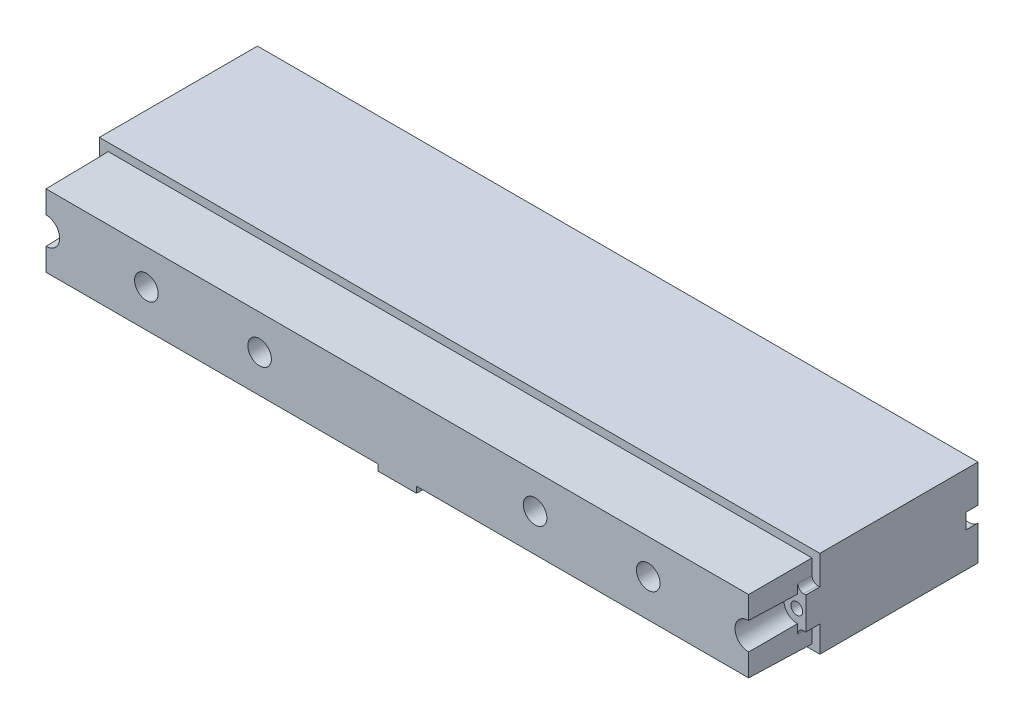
ISO-10303-21;
HEADER;
FILE_DESCRIPTION(('STEP AP214'),'2;1');
FILE_NAME('part.step','',(''),(''),'','','');
FILE_SCHEMA(('AUTOMOTIVE_DESIGN { 1 0 10303 214 1 1 1 1 }'));
ENDSEC;
DATA;
#1=APPLICATION_CONTEXT('core data for automotive mechanical design processes');
#2=APPLICATION_PROTOCOL_DEFINITION('international standard','automotive_design',2000,#1);
#3=PRODUCT_CONTEXT('',#1,'mechanical');
#4=PRODUCT('Part','Part','',(#3));
#5=PRODUCT_RELATED_PRODUCT_CATEGORY('part','',(#4));
#6=PRODUCT_DEFINITION_FORMATION('','',#4);
#7=PRODUCT_DEFINITION_CONTEXT('part definition',#1,'design');
#8=PRODUCT_DEFINITION('design','',#6,#7);
#9=PRODUCT_DEFINITION_SHAPE('','',#8);
#10=(LENGTH_UNIT() NAMED_UNIT(*) SI_UNIT(.MILLI.,.METRE.));
#11=(NAMED_UNIT(*) PLANE_ANGLE_UNIT() SI_UNIT($,.RADIAN.));
#12=(NAMED_UNIT(*) SI_UNIT($,.STERADIAN.) SOLID_ANGLE_UNIT());
#13=UNCERTAINTY_MEASURE_WITH_UNIT(LENGTH_MEASURE(1.E-05),#10,'distance_accuracy_value','');
#14=(GEOMETRIC_REPRESENTATION_CONTEXT(3) GLOBAL_UNCERTAINTY_ASSIGNED_CONTEXT((#13)) GLOBAL_UNIT_ASSIGNED_CONTEXT((#10,
#11,#12)) REPRESENTATION_CONTEXT('',''));
#15=CARTESIAN_POINT('',(0.,0.,0.));
#16=DIRECTION('',(0.,0.,1.));
#17=DIRECTION('',(1.,0.,0.));
#18=AXIS2_PLACEMENT_3D('',#15,#16,#17);
#19=CARTESIAN_POINT('',(170.,-124.,-56.));
#20=DIRECTION('',(0.,0.,1.));
#21=DIRECTION('',(1.,0.,0.));
#22=AXIS2_PLACEMENT_3D('',#19,#20,#21);
#23=PLANE('',#22);
#24=CARTESIAN_POINT('',(-34.9999919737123,51.0956836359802,-56.));
#25=DIRECTION('',(0.,0.,1.));
#26=DIRECTION('',(1.,0.,0.));
#27=AXIS2_PLACEMENT_3D('',#24,#25,#26);
#28=CIRCLE('',#27,3.);
#29=CARTESIAN_POINT('',(-31.9999919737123,51.0956836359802,-56.));
#30=VERTEX_POINT('',#29);
#31=EDGE_CURVE('E638',#30,#30,#28,.F.);
#32=ORIENTED_EDGE('',*,*,#31,.F.);
#33=EDGE_LOOP('',(#32));
#34=FACE_BOUND('',#33,.T.);
#35=CARTESIAN_POINT('',(76.5012080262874,51.0956836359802,-56.));
#36=DIRECTION('',(0.,0.,1.));
#37=DIRECTION('',(1.,0.,0.));
#38=AXIS2_PLACEMENT_3D('',#35,#36,#37);
#39=CIRCLE('',#38,4.);
#40=CARTESIAN_POINT('',(80.5012080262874,51.0956836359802,-56.));
#41=VERTEX_POINT('',#40);
#42=EDGE_CURVE('E25',#41,#41,#39,.T.);
#43=ORIENTED_EDGE('',*,*,#42,.T.);
#44=EDGE_LOOP('',(#43));
#45=FACE_BOUND('',#44,.T.);
#46=CARTESIAN_POINT('',(-76.5011919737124,51.0956836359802,-56.));
#47=DIRECTION('',(0.,0.,1.));
#48=DIRECTION('',(1.,0.,0.));
#49=AXIS2_PLACEMENT_3D('',#46,#47,#48);
#50=CIRCLE('',#49,4.);
#51=CARTESIAN_POINT('',(-72.5011919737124,51.0956836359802,-56.));
#52=VERTEX_POINT('',#51);
#53=EDGE_CURVE('E423',#52,#52,#50,.T.);
#54=ORIENTED_EDGE('',*,*,#53,.T.);
#55=EDGE_LOOP('',(#54));
#56=FACE_BOUND('',#55,.T.);
#57=CARTESIAN_POINT('',(63.7500080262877,51.0956758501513,-56.));
#58=DIRECTION('',(0.,0.,1.));
#59=DIRECTION('',(1.,0.,0.));
#60=AXIS2_PLACEMENT_3D('',#57,#58,#59);
#61=CIRCLE('',#60,3.);
#62=CARTESIAN_POINT('',(66.7500080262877,51.0956758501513,-56.));
#63=VERTEX_POINT('',#62);
#64=EDGE_CURVE('E450',#63,#63,#61,.F.);
#65=ORIENTED_EDGE('',*,*,#64,.F.);
#66=EDGE_LOOP('',(#65));
#67=FACE_BOUND('',#66,.T.);
#68=CARTESIAN_POINT('',(47.0000080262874,51.0956836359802,-56.));
#69=DIRECTION('',(0.,0.,1.));
#70=DIRECTION('',(1.,0.,0.));
#71=AXIS2_PLACEMENT_3D('',#68,#69,#70);
#72=CIRCLE('',#71,4.);
#73=CARTESIAN_POINT('',(51.0000080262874,51.0956836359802,-56.));
#74=VERTEX_POINT('',#73);
#75=EDGE_CURVE('E453',#74,#74,#72,.T.);
#76=ORIENTED_EDGE('',*,*,#75,.T.);
#77=EDGE_LOOP('',(#76));
#78=FACE_BOUND('',#77,.T.);
#79=CARTESIAN_POINT('',(-46.9999919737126,51.0956836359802,-56.));
#80=DIRECTION('',(0.,0.,1.));
#81=DIRECTION('',(1.,0.,0.));
#82=AXIS2_PLACEMENT_3D('',#79,#80,#81);
#83=CIRCLE('',#82,4.);
#84=CARTESIAN_POINT('',(-42.9999919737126,51.0956836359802,-56.));
#85=VERTEX_POINT('',#84);
#86=EDGE_CURVE('E552',#85,#85,#83,.T.);
#87=ORIENTED_EDGE('',*,*,#86,.T.);
#88=EDGE_LOOP('',(#87));
#89=FACE_BOUND('',#88,.T.);
#90=DIRECTION('',(0.,1.,0.));
#91=VECTOR('',#90,1.);
#92=CARTESIAN_POINT('',(91.5238680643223,62.1988680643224,-56.));
#93=LINE('',#92,#91);
#94=CARTESIAN_POINT('',(91.5238680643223,52.7019169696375,-56.));
#95=VERTEX_POINT('',#94);
#96=CARTESIAN_POINT('',(91.5238680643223,62.1988680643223,-56.));
#97=VERTEX_POINT('',#96);
#98=EDGE_CURVE('E546',#95,#97,#93,.T.);
#99=ORIENTED_EDGE('',*,*,#98,.F.);
#100=CARTESIAN_POINT('',(89.25,50.745,-56.));
#101=DIRECTION('',(0.,0.,-1.));
#102=DIRECTION('',(1.,0.,0.));
#103=AXIS2_PLACEMENT_3D('',#100,#101,#102);
#104=CIRCLE('',#103,3.);
#105=CARTESIAN_POINT('',(91.5238680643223,48.7880830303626,-56.));
#106=VERTEX_POINT('',#105);
#107=EDGE_CURVE('E653',#106,#95,#104,.T.);
#108=ORIENTED_EDGE('',*,*,#107,.F.);
#109=CARTESIAN_POINT('',(91.5238680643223,39.9924836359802,-56.));
#110=VERTEX_POINT('',#109);
#111=EDGE_CURVE('E566',#110,#106,#93,.T.);
#112=ORIENTED_EDGE('',*,*,#111,.F.);
#113=DIRECTION('',(1.,0.,0.));
#114=VECTOR('',#113,1.);
#115=CARTESIAN_POINT('',(-65.6145427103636,39.9924836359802,-56.));
#116=LINE('',#115,#114);
#117=CARTESIAN_POINT('',(-91.5238680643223,39.9924836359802,-56.));
#118=VERTEX_POINT('',#117);
#119=EDGE_CURVE('E392',#118,#110,#116,.T.);
#120=ORIENTED_EDGE('',*,*,#119,.F.);
#121=DIRECTION('',(0.,-1.,0.));
#122=VECTOR('',#121,1.);
#123=CARTESIAN_POINT('',(-91.5238680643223,39.015,-56.));
#124=LINE('',#123,#122);
#125=CARTESIAN_POINT('',(-91.5238680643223,48.7880830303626,-56.));
#126=VERTEX_POINT('',#125);
#127=EDGE_CURVE('E464',#126,#118,#124,.T.);
#128=ORIENTED_EDGE('',*,*,#127,.F.);
#129=CARTESIAN_POINT('',(-89.25,50.745,-56.));
#130=DIRECTION('',(0.,0.,-1.));
#131=DIRECTION('',(1.,0.,0.));
#132=AXIS2_PLACEMENT_3D('',#129,#130,#131);
#133=CIRCLE('',#132,3.);
#134=CARTESIAN_POINT('',(-91.5238680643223,52.7019169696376,-56.));
#135=VERTEX_POINT('',#134);
#136=EDGE_CURVE('E583',#135,#126,#133,.T.);
#137=ORIENTED_EDGE('',*,*,#136,.F.);
#138=CARTESIAN_POINT('',(-91.5238680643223,62.1988680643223,-56.));
#139=VERTEX_POINT('',#138);
#140=EDGE_CURVE('E459',#139,#135,#124,.T.);
#141=ORIENTED_EDGE('',*,*,#140,.F.);
#142=DIRECTION('',(-1.,0.,0.));
#143=VECTOR('',#142,1.);
#144=CARTESIAN_POINT('',(-91.5238680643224,62.1988680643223,-56.));
#145=LINE('',#144,#143);
#146=EDGE_CURVE('E469',#97,#139,#145,.T.);
#147=ORIENTED_EDGE('',*,*,#146,.F.);
#148=EDGE_LOOP('',(#99,#108,#112,#120,#128,#137,#141,#147));
#149=FACE_BOUND('',#148,.T.);
#150=CARTESIAN_POINT('',(-63.7499919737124,51.0956758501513,-56.));
#151=DIRECTION('',(0.,0.,1.));
#152=DIRECTION('',(1.,0.,0.));
#153=AXIS2_PLACEMENT_3D('',#150,#151,#152);
#154=CIRCLE('',#153,3.);
#155=CARTESIAN_POINT('',(-60.7499919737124,51.0956758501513,-56.));
#156=VERTEX_POINT('',#155);
#157=EDGE_CURVE('E455',#156,#156,#154,.F.);
#158=ORIENTED_EDGE('',*,*,#157,.F.);
#159=EDGE_LOOP('',(#158));
#160=FACE_BOUND('',#159,.T.);
#161=CARTESIAN_POINT('',(35.0000080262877,51.0956836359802,-56.));
#162=DIRECTION('',(0.,0.,1.));
#163=DIRECTION('',(1.,0.,0.));
#164=AXIS2_PLACEMENT_3D('',#161,#162,#163);
#165=CIRCLE('',#164,3.);
#166=CARTESIAN_POINT('',(38.0000080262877,51.0956836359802,-56.));
#167=VERTEX_POINT('',#166);
#168=EDGE_CURVE('E20',#167,#167,#165,.F.);
#169=ORIENTED_EDGE('',*,*,#168,.F.);
#170=EDGE_LOOP('',(#169));
#171=FACE_BOUND('',#170,.T.);
#172=ADVANCED_FACE('F16',(#34,#45,#56,#67,#78,#89,#149,#160,#171),#23,.F.);
#173=CARTESIAN_POINT('',(89.25,50.745,-130.249188));
#174=DIRECTION('',(0.,0.,1.));
#175=DIRECTION('',(1.,0.,0.));
#176=AXIS2_PLACEMENT_3D('',#173,#174,#175);
#177=CYLINDRICAL_SURFACE('',#176,1.5);
#178=CARTESIAN_POINT('',(89.25,50.745,-12.249588));
#179=DIRECTION('',(0.,0.,1.));
#180=DIRECTION('',(1.,0.,0.));
#181=AXIS2_PLACEMENT_3D('',#178,#179,#180);
#182=CIRCLE('',#181,1.5);
#183=CARTESIAN_POINT('',(90.75,50.745,-12.249588));
#184=VERTEX_POINT('',#183);
#185=EDGE_CURVE('E547',#184,#184,#182,.F.);
#186=ORIENTED_EDGE('',*,*,#185,.F.);
#187=EDGE_LOOP('',(#186));
#188=FACE_BOUND('',#187,.T.);
#189=CARTESIAN_POINT('',(89.25,50.745,-53.));
#190=DIRECTION('',(0.,0.,-1.));
#191=DIRECTION('',(-1.,0.,0.));
#192=AXIS2_PLACEMENT_3D('',#189,#190,#191);
#193=CIRCLE('',#192,1.5);
#194=CARTESIAN_POINT('',(87.75,50.745,-53.));
#195=VERTEX_POINT('',#194);
#196=EDGE_CURVE('E579',#195,#195,#193,.T.);
#197=ORIENTED_EDGE('',*,*,#196,.T.);
#198=EDGE_LOOP('',(#197));
#199=FACE_BOUND('',#198,.T.);
#200=ADVANCED_FACE('F255',(#188,#199),#177,.F.);
#201=CARTESIAN_POINT('',(-91.5238680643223,39.015,-61.719588));
#202=DIRECTION('',(1.,0.,0.));
#203=DIRECTION('',(0.,0.,-1.));
#204=AXIS2_PLACEMENT_3D('',#201,#202,#203);
#205=PLANE('',#204);
#206=DIRECTION('',(0.,0.,-1.));
#207=VECTOR('',#206,1.);
#208=CARTESIAN_POINT('',(-91.5238680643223,48.7880830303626,-53.));
#209=LINE('',#208,#207);
#210=CARTESIAN_POINT('',(-91.5238680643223,48.7880830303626,-53.));
#211=VERTEX_POINT('',#210);
#212=EDGE_CURVE('E569',#126,#211,#209,.F.);
#213=ORIENTED_EDGE('',*,*,#212,.F.);
#214=ORIENTED_EDGE('',*,*,#127,.T.);
#215=DIRECTION('',(0.,0.,-1.));
#216=VECTOR('',#215,1.);
#217=CARTESIAN_POINT('',(-91.5238680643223,39.9924836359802,-61.719588));
#218=LINE('',#217,#216);
#219=CARTESIAN_POINT('',(-91.5238680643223,39.9924836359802,-15.819588));
#220=VERTEX_POINT('',#219);
#221=EDGE_CURVE('E424',#118,#220,#218,.F.);
#222=ORIENTED_EDGE('',*,*,#221,.T.);
#223=DIRECTION('',(0.,-1.,0.));
#224=VECTOR('',#223,1.);
#225=CARTESIAN_POINT('',(-91.5238680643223,39.015,-15.819588));
#226=LINE('',#225,#224);
#227=CARTESIAN_POINT('',(-91.5238680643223,46.665,-15.819588));
#228=VERTEX_POINT('',#227);
#229=EDGE_CURVE('E498',#228,#220,#226,.T.);
#230=ORIENTED_EDGE('',*,*,#229,.F.);
#231=DIRECTION('',(0.,0.,1.));
#232=VECTOR('',#231,1.);
#233=CARTESIAN_POINT('',(-91.5238680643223,46.665,-61.719588));
#234=LINE('',#233,#232);
#235=CARTESIAN_POINT('',(-91.5238680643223,46.665,-12.249588));
#236=VERTEX_POINT('',#235);
#237=EDGE_CURVE('E426',#228,#236,#234,.T.);
#238=ORIENTED_EDGE('',*,*,#237,.T.);
#239=DIRECTION('',(0.,-1.,0.));
#240=VECTOR('',#239,1.);
#241=CARTESIAN_POINT('',(-91.5238680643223,39.015,-12.249588));
#242=LINE('',#241,#240);
#243=CARTESIAN_POINT('',(-91.5238680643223,54.825,-12.249588));
#244=VERTEX_POINT('',#243);
#245=EDGE_CURVE('E475',#244,#236,#242,.T.);
#246=ORIENTED_EDGE('',*,*,#245,.F.);
#247=DIRECTION('',(0.,0.,-1.));
#248=VECTOR('',#247,1.);
#249=CARTESIAN_POINT('',(-91.5238680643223,54.825,-61.719588));
#250=LINE('',#249,#248);
#251=CARTESIAN_POINT('',(-91.5238680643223,54.825,-15.819588));
#252=VERTEX_POINT('',#251);
#253=EDGE_CURVE('E474',#244,#252,#250,.T.);
#254=ORIENTED_EDGE('',*,*,#253,.T.);
#255=DIRECTION('',(0.,-1.,0.));
#256=VECTOR('',#255,1.);
#257=CARTESIAN_POINT('',(-91.5238680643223,39.015,-15.819588));
#258=LINE('',#257,#256);
#259=CARTESIAN_POINT('',(-91.5238680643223,62.1988680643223,-15.819588));
#260=VERTEX_POINT('',#259);
#261=EDGE_CURVE('E509',#260,#252,#258,.T.);
#262=ORIENTED_EDGE('',*,*,#261,.F.);
#263=DIRECTION('',(0.,0.,1.));
#264=VECTOR('',#263,1.);
#265=CARTESIAN_POINT('',(-91.5238680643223,62.1988680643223,-61.719588));
#266=LINE('',#265,#264);
#267=EDGE_CURVE('E449',#139,#260,#266,.T.);
#268=ORIENTED_EDGE('',*,*,#267,.F.);
#269=ORIENTED_EDGE('',*,*,#140,.T.);
#270=DIRECTION('',(0.,0.,-1.));
#271=VECTOR('',#270,1.);
#272=CARTESIAN_POINT('',(-91.5238680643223,52.7019169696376,-53.));
#273=LINE('',#272,#271);
#274=CARTESIAN_POINT('',(-91.5238680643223,52.7019169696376,-53.));
#275=VERTEX_POINT('',#274);
#276=EDGE_CURVE('E573',#275,#135,#273,.T.);
#277=ORIENTED_EDGE('',*,*,#276,.F.);
#278=DIRECTION('',(0.,-1.,0.));
#279=VECTOR('',#278,1.);
#280=CARTESIAN_POINT('',(-91.5238680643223,50.745,-53.));
#281=LINE('',#280,#279);
#282=EDGE_CURVE('E572',#275,#211,#281,.T.);
#283=ORIENTED_EDGE('',*,*,#282,.T.);
#284=EDGE_LOOP('',(#213,#214,#222,#230,#238,#246,#254,#262,#268,#269,#277,#283));
#285=FACE_BOUND('',#284,.T.);
#286=ADVANCED_FACE('F261',(#285),#205,.F.);
#287=CARTESIAN_POINT('',(-89.25,50.745,-130.249188));
#288=DIRECTION('',(0.,0.,1.));
#289=DIRECTION('',(1.,0.,0.));
#290=AXIS2_PLACEMENT_3D('',#287,#288,#289);
#291=CYLINDRICAL_SURFACE('',#290,1.5);
#292=CARTESIAN_POINT('',(-89.25,50.745,-12.249588));
#293=DIRECTION('',(0.,0.,1.));
#294=DIRECTION('',(1.,0.,0.));
#295=AXIS2_PLACEMENT_3D('',#292,#293,#294);
#296=CIRCLE('',#295,1.5);
#297=CARTESIAN_POINT('',(-87.75,50.745,-12.249588));
#298=VERTEX_POINT('',#297);
#299=EDGE_CURVE('E544',#298,#298,#296,.F.);
#300=ORIENTED_EDGE('',*,*,#299,.F.);
#301=EDGE_LOOP('',(#300));
#302=FACE_BOUND('',#301,.T.);
#303=CARTESIAN_POINT('',(-89.25,50.745,-53.));
#304=DIRECTION('',(0.,0.,-1.));
#305=DIRECTION('',(-1.,0.,0.));
#306=AXIS2_PLACEMENT_3D('',#303,#304,#305);
#307=CIRCLE('',#306,1.5);
#308=CARTESIAN_POINT('',(-90.75,50.745,-53.));
#309=VERTEX_POINT('',#308);
#310=EDGE_CURVE('E585',#309,#309,#307,.F.);
#311=ORIENTED_EDGE('',*,*,#310,.F.);
#312=EDGE_LOOP('',(#311));
#313=FACE_BOUND('',#312,.T.);
#314=ADVANCED_FACE('F268',(#302,#313),#291,.F.);
#315=CARTESIAN_POINT('',(83.64,46.665,-12.249588));
#316=DIRECTION('',(0.,0.,1.));
#317=DIRECTION('',(1.,0.,0.));
#318=AXIS2_PLACEMENT_3D('',#315,#316,#317);
#319=PLANE('',#318);
#320=DIRECTION('',(0.,1.,0.));
#321=VECTOR('',#320,1.);
#322=CARTESIAN_POINT('',(91.5238680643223,62.1988680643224,-12.249588));
#323=LINE('',#322,#321);
#324=CARTESIAN_POINT('',(91.5238680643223,46.665,-12.249588));
#325=VERTEX_POINT('',#324);
#326=CARTESIAN_POINT('',(91.5238680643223,54.825,-12.249588));
#327=VERTEX_POINT('',#326);
#328=EDGE_CURVE('E484',#325,#327,#323,.T.);
#329=ORIENTED_EDGE('',*,*,#328,.T.);
#330=DIRECTION('',(-1.,0.,0.));
#331=VECTOR('',#330,1.);
#332=CARTESIAN_POINT('',(91.8,54.825,-12.249588));
#333=LINE('',#332,#331);
#334=CARTESIAN_POINT('',(90.9640458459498,54.825,-12.249588));
#335=VERTEX_POINT('',#334);
#336=EDGE_CURVE('E343',#327,#335,#333,.T.);
#337=ORIENTED_EDGE('',*,*,#336,.T.);
#338=CARTESIAN_POINT('',(90.9640458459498,56.325,-12.249588));
#339=DIRECTION('',(0.,0.,1.));
#340=DIRECTION('',(1.,0.,0.));
#341=AXIS2_PLACEMENT_3D('',#338,#339,#340);
#342=ELLIPSE('',#341,1.50022849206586,1.5);
#343=CARTESIAN_POINT('',(89.4638173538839,56.325,-12.249588));
#344=VERTEX_POINT('',#343);
#345=EDGE_CURVE('E375',#335,#344,#342,.F.);
#346=ORIENTED_EDGE('',*,*,#345,.T.);
#347=DIRECTION('',(0.,1.,0.));
#348=VECTOR('',#347,1.);
#349=CARTESIAN_POINT('',(89.4638173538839,41.565,-12.249588));
#350=LINE('',#349,#348);
#351=CARTESIAN_POINT('',(89.4638173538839,53.9921505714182,-12.249588));
#352=VERTEX_POINT('',#351);
#353=EDGE_CURVE('E337',#352,#344,#350,.T.);
#354=ORIENTED_EDGE('',*,*,#353,.F.);
#355=CARTESIAN_POINT('',(89.25,50.745,-12.249588));
#356=DIRECTION('',(0.,0.,1.));
#357=DIRECTION('',(1.,0.,0.));
#358=AXIS2_PLACEMENT_3D('',#355,#356,#357);
#359=CIRCLE('',#358,3.25418264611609);
#360=CARTESIAN_POINT('',(89.4638173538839,47.4978494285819,-12.249588));
#361=VERTEX_POINT('',#360);
#362=EDGE_CURVE('E339',#352,#361,#359,.T.);
#363=ORIENTED_EDGE('',*,*,#362,.T.);
#364=DIRECTION('',(0.,1.,0.));
#365=VECTOR('',#364,1.);
#366=CARTESIAN_POINT('',(89.4638173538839,41.565,-12.249588));
#367=LINE('',#366,#365);
#368=CARTESIAN_POINT('',(89.4638173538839,45.165,-12.249588));
#369=VERTEX_POINT('',#368);
#370=EDGE_CURVE('E323',#369,#361,#367,.T.);
#371=ORIENTED_EDGE('',*,*,#370,.F.);
#372=CARTESIAN_POINT('',(90.9640458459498,45.165,-12.249588));
#373=DIRECTION('',(0.,0.,1.));
#374=DIRECTION('',(-1.,0.,0.));
#375=AXIS2_PLACEMENT_3D('',#372,#373,#374);
#376=ELLIPSE('',#375,1.50022849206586,1.5);
#377=CARTESIAN_POINT('',(90.9640458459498,46.665,-12.249588));
#378=VERTEX_POINT('',#377);
#379=EDGE_CURVE('E382',#369,#378,#376,.F.);
#380=ORIENTED_EDGE('',*,*,#379,.T.);
#381=DIRECTION('',(1.,0.,0.));
#382=VECTOR('',#381,1.);
#383=CARTESIAN_POINT('',(83.64,46.665,-12.249588));
#384=LINE('',#383,#382);
#385=EDGE_CURVE('E342',#378,#325,#384,.T.);
#386=ORIENTED_EDGE('',*,*,#385,.T.);
#387=EDGE_LOOP('',(#329,#337,#346,#354,#363,#371,#380,#386));
#388=FACE_BOUND('',#387,.T.);
#389=ORIENTED_EDGE('',*,*,#185,.T.);
#390=EDGE_LOOP('',(#389));
#391=FACE_BOUND('',#390,.T.);
#392=ADVANCED_FACE('F376',(#388,#391),#319,.T.);
#393=CARTESIAN_POINT('',(-83.64,46.665,-12.249588));
#394=DIRECTION('',(0.,0.,1.));
#395=DIRECTION('',(1.,0.,0.));
#396=AXIS2_PLACEMENT_3D('',#393,#394,#395);
#397=PLANE('',#396);
#398=ORIENTED_EDGE('',*,*,#245,.T.);
#399=DIRECTION('',(1.,0.,0.));
#400=VECTOR('',#399,1.);
#401=CARTESIAN_POINT('',(-91.8,46.665,-12.249588));
#402=LINE('',#401,#400);
#403=CARTESIAN_POINT('',(-90.9640458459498,46.665,-12.249588));
#404=VERTEX_POINT('',#403);
#405=EDGE_CURVE('E477',#236,#404,#402,.T.);
#406=ORIENTED_EDGE('',*,*,#405,.T.);
#407=CARTESIAN_POINT('',(-90.9640458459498,45.165,-12.249588));
#408=DIRECTION('',(0.,0.,1.));
#409=DIRECTION('',(-1.,0.,0.));
#410=AXIS2_PLACEMENT_3D('',#407,#408,#409);
#411=ELLIPSE('',#410,1.50022849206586,1.5);
#412=CARTESIAN_POINT('',(-89.4638173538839,45.165,-12.249588));
#413=VERTEX_POINT('',#412);
#414=EDGE_CURVE('E418',#404,#413,#411,.F.);
#415=ORIENTED_EDGE('',*,*,#414,.T.);
#416=DIRECTION('',(0.,-1.,0.));
#417=VECTOR('',#416,1.);
#418=CARTESIAN_POINT('',(-89.4638173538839,59.925,-12.249588));
#419=LINE('',#418,#417);
#420=CARTESIAN_POINT('',(-89.4638173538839,47.4978494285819,-12.249588));
#421=VERTEX_POINT('',#420);
#422=EDGE_CURVE('E308',#421,#413,#419,.T.);
#423=ORIENTED_EDGE('',*,*,#422,.F.);
#424=CARTESIAN_POINT('',(-89.25,50.745,-12.249588));
#425=DIRECTION('',(0.,0.,1.));
#426=DIRECTION('',(1.,0.,0.));
#427=AXIS2_PLACEMENT_3D('',#424,#425,#426);
#428=CIRCLE('',#427,3.25418264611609);
#429=CARTESIAN_POINT('',(-89.25,53.9991826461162,-12.249588));
#430=VERTEX_POINT('',#429);
#431=EDGE_CURVE('E515',#421,#430,#428,.T.);
#432=ORIENTED_EDGE('',*,*,#431,.T.);
#433=DIRECTION('',(0.,-1.,0.));
#434=VECTOR('',#433,1.);
#435=CARTESIAN_POINT('',(-89.25,59.925,-12.249588));
#436=LINE('',#435,#434);
#437=CARTESIAN_POINT('',(-89.25,56.325,-12.249588));
#438=VERTEX_POINT('',#437);
#439=EDGE_CURVE('E328',#438,#430,#436,.T.);
#440=ORIENTED_EDGE('',*,*,#439,.F.);
#441=CARTESIAN_POINT('',(-90.75,56.325,-12.249588));
#442=DIRECTION('',(0.,0.,1.));
#443=DIRECTION('',(1.,0.,0.));
#444=AXIS2_PLACEMENT_3D('',#441,#442,#443);
#445=CIRCLE('',#444,1.5);
#446=CARTESIAN_POINT('',(-90.75,54.825,-12.249588));
#447=VERTEX_POINT('',#446);
#448=EDGE_CURVE('E421',#438,#447,#445,.F.);
#449=ORIENTED_EDGE('',*,*,#448,.T.);
#450=DIRECTION('',(-1.,0.,0.));
#451=VECTOR('',#450,1.);
#452=CARTESIAN_POINT('',(-83.64,54.825,-12.249588));
#453=LINE('',#452,#451);
#454=EDGE_CURVE('E432',#447,#244,#453,.T.);
#455=ORIENTED_EDGE('',*,*,#454,.T.);
#456=EDGE_LOOP('',(#398,#406,#415,#423,#432,#440,#449,#455));
#457=FACE_BOUND('',#456,.T.);
#458=ORIENTED_EDGE('',*,*,#299,.T.);
#459=EDGE_LOOP('',(#458));
#460=FACE_BOUND('',#459,.T.);
#461=ADVANCED_FACE('F690',(#457,#460),#397,.T.);
#462=CARTESIAN_POINT('',(-91.8,64.515,0.));
#463=DIRECTION('',(0.,0.,1.));
#464=DIRECTION('',(1.,0.,0.));
#465=AXIS2_PLACEMENT_3D('',#462,#463,#464);
#466=PLANE('',#465);
#467=CARTESIAN_POINT('',(35.0000080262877,51.0956836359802,0.));
#468=DIRECTION('',(0.,0.,1.));
#469=DIRECTION('',(1.,0.,0.));
#470=AXIS2_PLACEMENT_3D('',#467,#468,#469);
#471=CIRCLE('',#470,3.);
#472=CARTESIAN_POINT('',(38.0000080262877,51.0956836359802,0.));
#473=VERTEX_POINT('',#472);
#474=EDGE_CURVE('E636',#473,#473,#471,.T.);
#475=ORIENTED_EDGE('',*,*,#474,.F.);
#476=EDGE_LOOP('',(#475));
#477=FACE_BOUND('',#476,.T.);
#478=CARTESIAN_POINT('',(-34.9999919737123,51.0956836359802,0.));
#479=DIRECTION('',(0.,0.,1.));
#480=DIRECTION('',(1.,0.,0.));
#481=AXIS2_PLACEMENT_3D('',#478,#479,#480);
#482=CIRCLE('',#481,3.);
#483=CARTESIAN_POINT('',(-31.9999919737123,51.0956836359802,0.));
#484=VERTEX_POINT('',#483);
#485=EDGE_CURVE('E635',#484,#484,#482,.T.);
#486=ORIENTED_EDGE('',*,*,#485,.F.);
#487=EDGE_LOOP('',(#486));
#488=FACE_BOUND('',#487,.T.);
#489=CARTESIAN_POINT('',(-63.7499919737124,51.0956758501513,0.));
#490=DIRECTION('',(0.,0.,1.));
#491=DIRECTION('',(1.,0.,0.));
#492=AXIS2_PLACEMENT_3D('',#489,#490,#491);
#493=CIRCLE('',#492,3.);
#494=CARTESIAN_POINT('',(-60.7499919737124,51.0956758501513,0.));
#495=VERTEX_POINT('',#494);
#496=EDGE_CURVE('E458',#495,#495,#493,.T.);
#497=ORIENTED_EDGE('',*,*,#496,.F.);
#498=EDGE_LOOP('',(#497));
#499=FACE_BOUND('',#498,.T.);
#500=CARTESIAN_POINT('',(63.7500080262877,51.0956758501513,0.));
#501=DIRECTION('',(0.,0.,1.));
#502=DIRECTION('',(1.,0.,0.));
#503=AXIS2_PLACEMENT_3D('',#500,#501,#502);
#504=CIRCLE('',#503,3.);
#505=CARTESIAN_POINT('',(66.7500080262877,51.0956758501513,0.));
#506=VERTEX_POINT('',#505);
#507=EDGE_CURVE('E454',#506,#506,#504,.T.);
#508=ORIENTED_EDGE('',*,*,#507,.F.);
#509=EDGE_LOOP('',(#508));
#510=FACE_BOUND('',#509,.T.);
#511=DIRECTION('',(1.,0.,0.));
#512=VECTOR('',#511,1.);
#513=CARTESIAN_POINT('',(-91.8,39.9924836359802,0.));
#514=LINE('',#513,#512);
#515=CARTESIAN_POINT('',(4.87095833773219,39.9924836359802,0.));
#516=VERTEX_POINT('',#515);
#517=CARTESIAN_POINT('',(-4.87095833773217,39.9924836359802,0.));
#518=VERTEX_POINT('',#517);
#519=EDGE_CURVE('E435',#516,#518,#514,.F.);
#520=ORIENTED_EDGE('',*,*,#519,.F.);
#521=DIRECTION('',(0.,-1.,0.));
#522=VECTOR('',#521,1.);
#523=CARTESIAN_POINT('',(4.87095833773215,-56.355,0.));
#524=LINE('',#523,#522);
#525=CARTESIAN_POINT('',(4.87095833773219,41.565,0.));
#526=VERTEX_POINT('',#525);
#527=EDGE_CURVE('E463',#516,#526,#524,.F.);
#528=ORIENTED_EDGE('',*,*,#527,.T.);
#529=DIRECTION('',(1.,0.,0.));
#530=VECTOR('',#529,1.);
#531=CARTESIAN_POINT('',(-89.25,41.565,0.));
#532=LINE('',#531,#530);
#533=CARTESIAN_POINT('',(89.25,41.565,0.));
#534=VERTEX_POINT('',#533);
#535=EDGE_CURVE('E539',#526,#534,#532,.T.);
#536=ORIENTED_EDGE('',*,*,#535,.T.);
#537=DIRECTION('',(0.,1.,0.));
#538=VECTOR('',#537,1.);
#539=CARTESIAN_POINT('',(89.25,41.565,0.));
#540=LINE('',#539,#538);
#541=CARTESIAN_POINT('',(89.2499999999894,47.277,0.));
#542=VERTEX_POINT('',#541);
#543=EDGE_CURVE('E713',#534,#542,#540,.T.);
#544=ORIENTED_EDGE('',*,*,#543,.T.);
#545=CARTESIAN_POINT('',(89.25,50.745,0.));
#546=DIRECTION('',(0.,0.,1.));
#547=DIRECTION('',(1.,0.,0.));
#548=AXIS2_PLACEMENT_3D('',#545,#546,#547);
#549=CIRCLE('',#548,3.468);
#550=CARTESIAN_POINT('',(89.25,54.213,0.));
#551=VERTEX_POINT('',#550);
#552=EDGE_CURVE('E319',#551,#542,#549,.T.);
#553=ORIENTED_EDGE('',*,*,#552,.F.);
#554=CARTESIAN_POINT('',(89.25,59.925,0.));
#555=VERTEX_POINT('',#554);
#556=EDGE_CURVE('E715',#551,#555,#540,.T.);
#557=ORIENTED_EDGE('',*,*,#556,.T.);
#558=DIRECTION('',(-1.,0.,0.));
#559=VECTOR('',#558,1.);
#560=CARTESIAN_POINT('',(89.25,59.925,0.));
#561=LINE('',#560,#559);
#562=CARTESIAN_POINT('',(-89.25,59.925,0.));
#563=VERTEX_POINT('',#562);
#564=EDGE_CURVE('E724',#555,#563,#561,.T.);
#565=ORIENTED_EDGE('',*,*,#564,.T.);
#566=DIRECTION('',(0.,-1.,0.));
#567=VECTOR('',#566,1.);
#568=CARTESIAN_POINT('',(-89.25,59.925,0.));
#569=LINE('',#568,#567);
#570=CARTESIAN_POINT('',(-89.2500000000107,54.213,0.));
#571=VERTEX_POINT('',#570);
#572=EDGE_CURVE('E721',#563,#571,#569,.T.);
#573=ORIENTED_EDGE('',*,*,#572,.T.);
#574=CARTESIAN_POINT('',(-89.25,50.745,0.));
#575=DIRECTION('',(0.,0.,1.));
#576=DIRECTION('',(1.,0.,0.));
#577=AXIS2_PLACEMENT_3D('',#574,#575,#576);
#578=CIRCLE('',#577,3.468);
#579=CARTESIAN_POINT('',(-89.25,47.277,0.));
#580=VERTEX_POINT('',#579);
#581=EDGE_CURVE('E530',#580,#571,#578,.T.);
#582=ORIENTED_EDGE('',*,*,#581,.F.);
#583=CARTESIAN_POINT('',(-89.25,41.565,0.));
#584=VERTEX_POINT('',#583);
#585=EDGE_CURVE('E719',#580,#584,#569,.T.);
#586=ORIENTED_EDGE('',*,*,#585,.T.);
#587=CARTESIAN_POINT('',(-4.87095833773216,41.565,0.));
#588=VERTEX_POINT('',#587);
#589=EDGE_CURVE('E537',#584,#588,#532,.T.);
#590=ORIENTED_EDGE('',*,*,#589,.T.);
#591=DIRECTION('',(0.,1.,0.));
#592=VECTOR('',#591,1.);
#593=CARTESIAN_POINT('',(-4.87095833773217,41.565,0.));
#594=LINE('',#593,#592);
#595=EDGE_CURVE('E427',#588,#518,#594,.F.);
#596=ORIENTED_EDGE('',*,*,#595,.T.);
#597=EDGE_LOOP('',(#520,#528,#536,#544,#553,#557,#565,#573,#582,#586,#590,#596));
#598=FACE_BOUND('',#597,.T.);
#599=ADVANCED_FACE('F273',(#477,#488,#499,#510,#598),#466,.T.);
#600=CARTESIAN_POINT('',(-91.5238680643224,62.1988680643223,-61.719588));
#601=DIRECTION('',(0.,-1.,0.));
#602=DIRECTION('',(0.,0.,-1.));
#603=AXIS2_PLACEMENT_3D('',#600,#601,#602);
#604=PLANE('',#603);
#605=DIRECTION('',(0.,0.,1.));
#606=VECTOR('',#605,1.);
#607=CARTESIAN_POINT('',(91.5238680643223,62.1988680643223,-61.719588));
#608=LINE('',#607,#606);
#609=CARTESIAN_POINT('',(91.5238680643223,62.1988680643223,-15.819588));
#610=VERTEX_POINT('',#609);
#611=EDGE_CURVE('E448',#97,#610,#608,.T.);
#612=ORIENTED_EDGE('',*,*,#611,.F.);
#613=ORIENTED_EDGE('',*,*,#146,.T.);
#614=ORIENTED_EDGE('',*,*,#267,.T.);
#615=DIRECTION('',(-1.,0.,0.));
#616=VECTOR('',#615,1.);
#617=CARTESIAN_POINT('',(91.8,62.1988680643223,-15.819588));
#618=LINE('',#617,#616);
#619=EDGE_CURVE('E506',#610,#260,#618,.T.);
#620=ORIENTED_EDGE('',*,*,#619,.F.);
#621=EDGE_LOOP('',(#612,#613,#614,#620));
#622=FACE_BOUND('',#621,.T.);
#623=ADVANCED_FACE('F269',(#622),#604,.F.);
#624=CARTESIAN_POINT('',(91.5238680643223,62.1988680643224,-61.719588));
#625=DIRECTION('',(-1.,0.,0.));
#626=DIRECTION('',(0.,0.,1.));
#627=AXIS2_PLACEMENT_3D('',#624,#625,#626);
#628=PLANE('',#627);
#629=DIRECTION('',(0.,-1.,0.));
#630=VECTOR('',#629,1.);
#631=CARTESIAN_POINT('',(91.5238680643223,50.745,-53.));
#632=LINE('',#631,#630);
#633=CARTESIAN_POINT('',(91.5238680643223,52.7019169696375,-53.));
#634=VERTEX_POINT('',#633);
#635=CARTESIAN_POINT('',(91.5238680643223,48.7880830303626,-53.));
#636=VERTEX_POINT('',#635);
#637=EDGE_CURVE('E652',#634,#636,#632,.T.);
#638=ORIENTED_EDGE('',*,*,#637,.F.);
#639=DIRECTION('',(0.,0.,-1.));
#640=VECTOR('',#639,1.);
#641=CARTESIAN_POINT('',(91.5238680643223,52.7019169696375,-53.));
#642=LINE('',#641,#640);
#643=EDGE_CURVE('E651',#634,#95,#642,.T.);
#644=ORIENTED_EDGE('',*,*,#643,.T.);
#645=ORIENTED_EDGE('',*,*,#98,.T.);
#646=ORIENTED_EDGE('',*,*,#611,.T.);
#647=DIRECTION('',(0.,1.,0.));
#648=VECTOR('',#647,1.);
#649=CARTESIAN_POINT('',(91.5238680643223,39.015,-15.819588));
#650=LINE('',#649,#648);
#651=CARTESIAN_POINT('',(91.5238680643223,54.825,-15.819588));
#652=VERTEX_POINT('',#651);
#653=EDGE_CURVE('E503',#652,#610,#650,.T.);
#654=ORIENTED_EDGE('',*,*,#653,.F.);
#655=DIRECTION('',(0.,0.,1.));
#656=VECTOR('',#655,1.);
#657=CARTESIAN_POINT('',(91.5238680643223,54.825,-61.719588));
#658=LINE('',#657,#656);
#659=EDGE_CURVE('E481',#652,#327,#658,.T.);
#660=ORIENTED_EDGE('',*,*,#659,.T.);
#661=ORIENTED_EDGE('',*,*,#328,.F.);
#662=DIRECTION('',(0.,0.,-1.));
#663=VECTOR('',#662,1.);
#664=CARTESIAN_POINT('',(91.5238680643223,46.665,-61.719588));
#665=LINE('',#664,#663);
#666=CARTESIAN_POINT('',(91.5238680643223,46.665,-15.819588));
#667=VERTEX_POINT('',#666);
#668=EDGE_CURVE('E444',#325,#667,#665,.T.);
#669=ORIENTED_EDGE('',*,*,#668,.T.);
#670=DIRECTION('',(0.,1.,0.));
#671=VECTOR('',#670,1.);
#672=CARTESIAN_POINT('',(91.5238680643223,39.015,-15.819588));
#673=LINE('',#672,#671);
#674=CARTESIAN_POINT('',(91.5238680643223,39.9924836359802,-15.819588));
#675=VERTEX_POINT('',#674);
#676=EDGE_CURVE('E443',#675,#667,#673,.T.);
#677=ORIENTED_EDGE('',*,*,#676,.F.);
#678=DIRECTION('',(0.,0.,1.));
#679=VECTOR('',#678,1.);
#680=CARTESIAN_POINT('',(91.5238680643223,39.9924836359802,-61.719588));
#681=LINE('',#680,#679);
#682=EDGE_CURVE('E445',#675,#110,#681,.F.);
#683=ORIENTED_EDGE('',*,*,#682,.T.);
#684=ORIENTED_EDGE('',*,*,#111,.T.);
#685=DIRECTION('',(0.,0.,-1.));
#686=VECTOR('',#685,1.);
#687=CARTESIAN_POINT('',(91.5238680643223,48.7880830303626,-53.));
#688=LINE('',#687,#686);
#689=EDGE_CURVE('E654',#106,#636,#688,.F.);
#690=ORIENTED_EDGE('',*,*,#689,.T.);
#691=EDGE_LOOP('',(#638,#644,#645,#646,#654,#660,#661,#669,#677,#683,#684,#690));
#692=FACE_BOUND('',#691,.T.);
#693=ADVANCED_FACE('F272',(#692),#628,.F.);
#694=CARTESIAN_POINT('',(-65.6145427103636,39.9924836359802,-56.));
#695=DIRECTION('',(0.,-1.,0.));
#696=DIRECTION('',(1.,0.,0.));
#697=AXIS2_PLACEMENT_3D('',#694,#695,#696);
#698=PLANE('',#697);
#699=ORIENTED_EDGE('',*,*,#221,.F.);
#700=ORIENTED_EDGE('',*,*,#119,.T.);
#701=ORIENTED_EDGE('',*,*,#682,.F.);
#702=DIRECTION('',(-1.,0.,0.));
#703=VECTOR('',#702,1.);
#704=CARTESIAN_POINT('',(-65.6145427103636,39.9924836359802,-15.819588));
#705=LINE('',#704,#703);
#706=CARTESIAN_POINT('',(5.14709027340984,39.9924836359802,-15.819588));
#707=VERTEX_POINT('',#706);
#708=EDGE_CURVE('E440',#707,#675,#705,.F.);
#709=ORIENTED_EDGE('',*,*,#708,.F.);
#710=DIRECTION('',(-0.0174524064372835,0.,0.999847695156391));
#711=VECTOR('',#710,1.);
#712=CARTESIAN_POINT('',(5.049,39.9924836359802,-10.2));
#713=LINE('',#712,#711);
#714=EDGE_CURVE('E437',#707,#516,#713,.T.);
#715=ORIENTED_EDGE('',*,*,#714,.T.);
#716=ORIENTED_EDGE('',*,*,#519,.T.);
#717=DIRECTION('',(-0.0174524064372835,0.,-0.999847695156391));
#718=VECTOR('',#717,1.);
#719=CARTESIAN_POINT('',(-5.049,39.9924836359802,-10.2));
#720=LINE('',#719,#718);
#721=CARTESIAN_POINT('',(-5.14709027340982,39.9924836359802,-15.819588));
#722=VERTEX_POINT('',#721);
#723=EDGE_CURVE('E433',#518,#722,#720,.T.);
#724=ORIENTED_EDGE('',*,*,#723,.T.);
#725=DIRECTION('',(-1.,0.,0.));
#726=VECTOR('',#725,1.);
#727=CARTESIAN_POINT('',(-65.6145427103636,39.9924836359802,-15.819588));
#728=LINE('',#727,#726);
#729=EDGE_CURVE('E428',#220,#722,#728,.F.);
#730=ORIENTED_EDGE('',*,*,#729,.F.);
#731=EDGE_LOOP('',(#699,#700,#701,#709,#715,#716,#724,#730));
#732=FACE_BOUND('',#731,.T.);
#733=ADVANCED_FACE('F789',(#732),#698,.T.);
#734=CARTESIAN_POINT('',(91.8,39.015,-15.819588));
#735=DIRECTION('',(0.,0.,1.));
#736=DIRECTION('',(1.,0.,0.));
#737=AXIS2_PLACEMENT_3D('',#734,#735,#736);
#738=PLANE('',#737);
#739=DIRECTION('',(1.,0.,0.));
#740=VECTOR('',#739,1.);
#741=CARTESIAN_POINT('',(83.64,46.665,-15.819588));
#742=LINE('',#741,#740);
#743=CARTESIAN_POINT('',(91.0263604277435,46.665,-15.819588));
#744=VERTEX_POINT('',#743);
#745=EDGE_CURVE('E486',#744,#667,#742,.T.);
#746=ORIENTED_EDGE('',*,*,#745,.F.);
#747=CARTESIAN_POINT('',(91.0263604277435,45.165,-15.819588));
#748=DIRECTION('',(0.,0.,1.));
#749=DIRECTION('',(-1.,0.,0.));
#750=AXIS2_PLACEMENT_3D('',#747,#748,#749);
#751=ELLIPSE('',#750,1.50022849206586,1.5);
#752=CARTESIAN_POINT('',(89.5261319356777,45.165,-15.819588));
#753=VERTEX_POINT('',#752);
#754=EDGE_CURVE('E400',#744,#753,#751,.T.);
#755=ORIENTED_EDGE('',*,*,#754,.T.);
#756=DIRECTION('',(0.,1.,0.));
#757=VECTOR('',#756,1.);
#758=CARTESIAN_POINT('',(89.5261319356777,41.565,-15.819588));
#759=LINE('',#758,#757);
#760=CARTESIAN_POINT('',(89.5261319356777,41.2888680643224,-15.819588));
#761=VERTEX_POINT('',#760);
#762=EDGE_CURVE('E316',#761,#753,#759,.T.);
#763=ORIENTED_EDGE('',*,*,#762,.F.);
#764=DIRECTION('',(1.,0.,0.));
#765=VECTOR('',#764,1.);
#766=CARTESIAN_POINT('',(-89.25,41.2888680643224,-15.819588));
#767=LINE('',#766,#765);
#768=CARTESIAN_POINT('',(5.14709027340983,41.2888680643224,-15.819588));
#769=VERTEX_POINT('',#768);
#770=EDGE_CURVE('E321',#769,#761,#767,.T.);
#771=ORIENTED_EDGE('',*,*,#770,.F.);
#772=DIRECTION('',(0.,-1.,0.));
#773=VECTOR('',#772,1.);
#774=CARTESIAN_POINT('',(5.14709027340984,39.015,-15.819588));
#775=LINE('',#774,#773);
#776=EDGE_CURVE('E439',#707,#769,#775,.F.);
#777=ORIENTED_EDGE('',*,*,#776,.F.);
#778=ORIENTED_EDGE('',*,*,#708,.T.);
#779=ORIENTED_EDGE('',*,*,#676,.T.);
#780=EDGE_LOOP('',(#746,#755,#763,#771,#777,#778,#779));
#781=FACE_BOUND('',#780,.T.);
#782=ADVANCED_FACE('F735',(#781),#738,.T.);
#783=CARTESIAN_POINT('',(83.64,46.665,-12.249588));
#784=DIRECTION('',(0.,1.,0.));
#785=DIRECTION('',(0.,0.,1.));
#786=AXIS2_PLACEMENT_3D('',#783,#784,#785);
#787=PLANE('',#786);
#788=ORIENTED_EDGE('',*,*,#385,.F.);
#789=DIRECTION('',(0.0174524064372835,0.,-0.999847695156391));
#790=VECTOR('',#789,1.);
#791=CARTESIAN_POINT('',(91.0259034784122,46.665,-15.7934093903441));
#792=LINE('',#791,#790);
#793=EDGE_CURVE('E397',#378,#744,#792,.T.);
#794=ORIENTED_EDGE('',*,*,#793,.T.);
#795=ORIENTED_EDGE('',*,*,#745,.T.);
#796=ORIENTED_EDGE('',*,*,#668,.F.);
#797=EDGE_LOOP('',(#788,#794,#795,#796));
#798=FACE_BOUND('',#797,.T.);
#799=ADVANCED_FACE('F742',(#798),#787,.F.);
#800=DIRECTION('',(0.,1.,0.));
#801=VECTOR('',#800,1.);
#802=CARTESIAN_POINT('',(89.5261319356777,41.565,-15.819588));
#803=LINE('',#802,#801);
#804=CARTESIAN_POINT('',(89.5261319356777,56.325,-15.819588));
#805=VERTEX_POINT('',#804);
#806=CARTESIAN_POINT('',(89.5261319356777,60.2011319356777,-15.819588));
#807=VERTEX_POINT('',#806);
#808=EDGE_CURVE('E333',#805,#807,#803,.T.);
#809=ORIENTED_EDGE('',*,*,#808,.F.);
#810=CARTESIAN_POINT('',(91.0263604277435,56.325,-15.819588));
#811=DIRECTION('',(0.,0.,1.));
#812=DIRECTION('',(1.,0.,0.));
#813=AXIS2_PLACEMENT_3D('',#810,#811,#812);
#814=ELLIPSE('',#813,1.50022849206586,1.5);
#815=CARTESIAN_POINT('',(91.0263604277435,54.825,-15.819588));
#816=VERTEX_POINT('',#815);
#817=EDGE_CURVE('E387',#805,#816,#814,.T.);
#818=ORIENTED_EDGE('',*,*,#817,.T.);
#819=DIRECTION('',(-1.,0.,0.));
#820=VECTOR('',#819,1.);
#821=CARTESIAN_POINT('',(91.8,54.825,-15.819588));
#822=LINE('',#821,#820);
#823=EDGE_CURVE('E512',#652,#816,#822,.T.);
#824=ORIENTED_EDGE('',*,*,#823,.F.);
#825=ORIENTED_EDGE('',*,*,#653,.T.);
#826=ORIENTED_EDGE('',*,*,#619,.T.);
#827=ORIENTED_EDGE('',*,*,#261,.T.);
#828=DIRECTION('',(-1.,0.,0.));
#829=VECTOR('',#828,1.);
#830=CARTESIAN_POINT('',(-83.64,54.825,-15.819588));
#831=LINE('',#830,#829);
#832=CARTESIAN_POINT('',(-90.75,54.825,-15.819588));
#833=VERTEX_POINT('',#832);
#834=EDGE_CURVE('E478',#833,#252,#831,.T.);
#835=ORIENTED_EDGE('',*,*,#834,.F.);
#836=CARTESIAN_POINT('',(-90.75,56.325,-15.819588));
#837=DIRECTION('',(0.,0.,1.));
#838=DIRECTION('',(1.,0.,0.));
#839=AXIS2_PLACEMENT_3D('',#836,#837,#838);
#840=CIRCLE('',#839,1.5);
#841=CARTESIAN_POINT('',(-89.25,56.325,-15.819588));
#842=VERTEX_POINT('',#841);
#843=EDGE_CURVE('E388',#833,#842,#840,.T.);
#844=ORIENTED_EDGE('',*,*,#843,.T.);
#845=DIRECTION('',(0.,-1.,0.));
#846=VECTOR('',#845,1.);
#847=CARTESIAN_POINT('',(-89.25,59.925,-15.819588));
#848=LINE('',#847,#846);
#849=CARTESIAN_POINT('',(-89.25,60.2011319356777,-15.819588));
#850=VERTEX_POINT('',#849);
#851=EDGE_CURVE('E327',#850,#842,#848,.T.);
#852=ORIENTED_EDGE('',*,*,#851,.F.);
#853=DIRECTION('',(-1.,0.,0.));
#854=VECTOR('',#853,1.);
#855=CARTESIAN_POINT('',(89.25,60.2011319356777,-15.819588));
#856=LINE('',#855,#854);
#857=EDGE_CURVE('E329',#807,#850,#856,.T.);
#858=ORIENTED_EDGE('',*,*,#857,.F.);
#859=EDGE_LOOP('',(#809,#818,#824,#825,#826,#827,#835,#844,#852,#858));
#860=FACE_BOUND('',#859,.T.);
#861=ADVANCED_FACE('F756',(#860),#738,.T.);
#862=CARTESIAN_POINT('',(91.8,54.825,-12.249588));
#863=DIRECTION('',(0.,-1.,0.));
#864=DIRECTION('',(0.,0.,-1.));
#865=AXIS2_PLACEMENT_3D('',#862,#863,#864);
#866=PLANE('',#865);
#867=ORIENTED_EDGE('',*,*,#823,.T.);
#868=DIRECTION('',(-0.0174524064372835,0.,0.999847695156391));
#869=VECTOR('',#868,1.);
#870=CARTESIAN_POINT('',(90.9635888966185,54.825,-12.2234093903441));
#871=LINE('',#870,#869);
#872=EDGE_CURVE('E389',#816,#335,#871,.T.);
#873=ORIENTED_EDGE('',*,*,#872,.T.);
#874=ORIENTED_EDGE('',*,*,#336,.F.);
#875=ORIENTED_EDGE('',*,*,#659,.F.);
#876=EDGE_LOOP('',(#867,#873,#874,#875));
#877=FACE_BOUND('',#876,.T.);
#878=ADVANCED_FACE('F799',(#877),#866,.F.);
#879=CARTESIAN_POINT('',(-83.64,54.825,-12.249588));
#880=DIRECTION('',(0.,-1.,0.));
#881=DIRECTION('',(0.,0.,-1.));
#882=AXIS2_PLACEMENT_3D('',#879,#880,#881);
#883=PLANE('',#882);
#884=ORIENTED_EDGE('',*,*,#454,.F.);
#885=DIRECTION('',(0.,0.,-1.));
#886=VECTOR('',#885,1.);
#887=CARTESIAN_POINT('',(-90.75,54.825,-15.819588));
#888=LINE('',#887,#886);
#889=EDGE_CURVE('E412',#447,#833,#888,.T.);
#890=ORIENTED_EDGE('',*,*,#889,.T.);
#891=ORIENTED_EDGE('',*,*,#834,.T.);
#892=ORIENTED_EDGE('',*,*,#253,.F.);
#893=EDGE_LOOP('',(#884,#890,#891,#892));
#894=FACE_BOUND('',#893,.T.);
#895=ADVANCED_FACE('F768',(#894),#883,.F.);
#896=DIRECTION('',(0.,-1.,0.));
#897=VECTOR('',#896,1.);
#898=CARTESIAN_POINT('',(-89.5261319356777,59.925,-15.819588));
#899=LINE('',#898,#897);
#900=CARTESIAN_POINT('',(-89.5261319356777,45.165,-15.819588));
#901=VERTEX_POINT('',#900);
#902=CARTESIAN_POINT('',(-89.5261319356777,41.2888680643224,-15.819588));
#903=VERTEX_POINT('',#902);
#904=EDGE_CURVE('E309',#901,#903,#899,.T.);
#905=ORIENTED_EDGE('',*,*,#904,.F.);
#906=CARTESIAN_POINT('',(-91.0263604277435,45.165,-15.819588));
#907=DIRECTION('',(0.,0.,1.));
#908=DIRECTION('',(-1.,0.,0.));
#909=AXIS2_PLACEMENT_3D('',#906,#907,#908);
#910=ELLIPSE('',#909,1.50022849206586,1.5);
#911=CARTESIAN_POINT('',(-91.0263604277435,46.665,-15.819588));
#912=VERTEX_POINT('',#911);
#913=EDGE_CURVE('E410',#901,#912,#910,.T.);
#914=ORIENTED_EDGE('',*,*,#913,.T.);
#915=DIRECTION('',(1.,0.,0.));
#916=VECTOR('',#915,1.);
#917=CARTESIAN_POINT('',(-91.8,46.665,-15.819588));
#918=LINE('',#917,#916);
#919=EDGE_CURVE('E492',#228,#912,#918,.T.);
#920=ORIENTED_EDGE('',*,*,#919,.F.);
#921=ORIENTED_EDGE('',*,*,#229,.T.);
#922=ORIENTED_EDGE('',*,*,#729,.T.);
#923=DIRECTION('',(0.,-1.,0.));
#924=VECTOR('',#923,1.);
#925=CARTESIAN_POINT('',(-5.14709027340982,41.565,-15.819588));
#926=LINE('',#925,#924);
#927=CARTESIAN_POINT('',(-5.14709027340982,41.2888680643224,-15.819588));
#928=VERTEX_POINT('',#927);
#929=EDGE_CURVE('E431',#722,#928,#926,.F.);
#930=ORIENTED_EDGE('',*,*,#929,.T.);
#931=DIRECTION('',(1.,0.,0.));
#932=VECTOR('',#931,1.);
#933=CARTESIAN_POINT('',(-89.25,41.2888680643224,-15.819588));
#934=LINE('',#933,#932);
#935=EDGE_CURVE('E315',#903,#928,#934,.T.);
#936=ORIENTED_EDGE('',*,*,#935,.F.);
#937=EDGE_LOOP('',(#905,#914,#920,#921,#922,#930,#936));
#938=FACE_BOUND('',#937,.T.);
#939=ADVANCED_FACE('F791',(#938),#738,.T.);
#940=CARTESIAN_POINT('',(-91.8,46.665,-12.249588));
#941=DIRECTION('',(0.,1.,0.));
#942=DIRECTION('',(0.,0.,1.));
#943=AXIS2_PLACEMENT_3D('',#940,#941,#942);
#944=PLANE('',#943);
#945=ORIENTED_EDGE('',*,*,#919,.T.);
#946=DIRECTION('',(0.0174524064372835,0.,0.999847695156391));
#947=VECTOR('',#946,1.);
#948=CARTESIAN_POINT('',(-90.9635888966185,46.665,-12.2234093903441));
#949=LINE('',#948,#947);
#950=EDGE_CURVE('E405',#912,#404,#949,.T.);
#951=ORIENTED_EDGE('',*,*,#950,.T.);
#952=ORIENTED_EDGE('',*,*,#405,.F.);
#953=ORIENTED_EDGE('',*,*,#237,.F.);
#954=EDGE_LOOP('',(#945,#951,#952,#953));
#955=FACE_BOUND('',#954,.T.);
#956=ADVANCED_FACE('F285',(#955),#944,.F.);
#957=CARTESIAN_POINT('',(-89.25,41.565,0.));
#958=DIRECTION('',(0.,0.999847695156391,-0.0174524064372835));
#959=DIRECTION('',(0.,0.0174524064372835,0.999847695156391));
#960=AXIS2_PLACEMENT_3D('',#957,#958,#959);
#961=PLANE('',#960);
#962=DIRECTION('',(-0.0174497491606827,0.0174497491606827,0.999695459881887));
#963=VECTOR('',#962,1.);
#964=CARTESIAN_POINT('',(4.8422990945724,41.5936592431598,1.64188694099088));
#965=LINE('',#964,#963);
#966=EDGE_CURVE('E324',#526,#769,#965,.F.);
#967=ORIENTED_EDGE('',*,*,#966,.T.);
#968=ORIENTED_EDGE('',*,*,#770,.T.);
#969=DIRECTION('',(0.0174497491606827,-0.0174497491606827,-0.999695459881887));
#970=VECTOR('',#969,1.);
#971=CARTESIAN_POINT('',(89.25,41.565,0.));
#972=LINE('',#971,#970);
#973=EDGE_CURVE('E320',#534,#761,#972,.T.);
#974=ORIENTED_EDGE('',*,*,#973,.F.);
#975=ORIENTED_EDGE('',*,*,#535,.F.);
#976=EDGE_LOOP('',(#967,#968,#974,#975));
#977=FACE_BOUND('',#976,.T.);
#978=ADVANCED_FACE('F281',(#977),#961,.F.);
#979=CARTESIAN_POINT('',(89.25,41.565,0.));
#980=DIRECTION('',(-0.999847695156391,0.,-0.0174524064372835));
#981=DIRECTION('',(-0.0174524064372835,0.,0.999847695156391));
#982=AXIS2_PLACEMENT_3D('',#979,#980,#981);
#983=PLANE('',#982);
#984=ORIENTED_EDGE('',*,*,#762,.T.);
#985=DIRECTION('',(0.0174524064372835,0.,-0.999847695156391));
#986=VECTOR('',#985,1.);
#987=CARTESIAN_POINT('',(89.4638173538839,45.165,-12.249588));
#988=LINE('',#987,#986);
#989=EDGE_CURVE('E402',#753,#369,#988,.F.);
#990=ORIENTED_EDGE('',*,*,#989,.T.);
#991=ORIENTED_EDGE('',*,*,#370,.T.);
#992=CARTESIAN_POINT('',(89.25,47.277,1.83239855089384E-13));
#993=CARTESIAN_POINT('',(89.269825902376,47.2968264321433,-1.13582518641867));
#994=CARTESIAN_POINT('',(89.2896517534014,47.3168218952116,-2.27164743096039));
#995=CARTESIAN_POINT('',(89.3293033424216,47.3571711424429,-4.54328544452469));
#996=CARTESIAN_POINT('',(89.3491290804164,47.3775249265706,-5.67910121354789));
#997=CARTESIAN_POINT('',(89.4005757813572,47.4308332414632,-8.62648073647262));
#998=CARTESIAN_POINT('',(89.4321966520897,47.4640800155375,-10.4380392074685));
#999=CARTESIAN_POINT('',(89.4638173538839,47.4978494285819,-12.249588));
#1000=B_SPLINE_CURVE_WITH_KNOTS('',3,(#992,#993,#994,#995,#996,#997,#998,#999),.UNSPECIFIED.,
.F.,.F.,(4,2,2,4),(0.,3.40851361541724,6.81702689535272,12.2534449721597),.UNSPECIFIED.);
#1001=EDGE_CURVE('E336',#542,#361,#1000,.T.);
#1002=ORIENTED_EDGE('',*,*,#1001,.F.);
#1003=ORIENTED_EDGE('',*,*,#543,.F.);
#1004=ORIENTED_EDGE('',*,*,#973,.T.);
#1005=EDGE_LOOP('',(#984,#990,#991,#1002,#1003,#1004));
#1006=FACE_BOUND('',#1005,.T.);
#1007=ADVANCED_FACE('F284',(#1006),#983,.F.);
#1008=CARTESIAN_POINT('',(89.25,50.745,0.));
#1009=DIRECTION('',(0.,0.,1.));
#1010=DIRECTION('',(1.,0.,0.));
#1011=AXIS2_PLACEMENT_3D('',#1008,#1009,#1010);
#1012=CONICAL_SURFACE('',#1011,3.468,0.0174532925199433);
#1013=CARTESIAN_POINT('',(89.25,54.213,1.83239855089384E-13));
#1014=CARTESIAN_POINT('',(89.269825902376,54.1931735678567,-1.13582518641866));
#1015=CARTESIAN_POINT('',(89.2896517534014,54.1731781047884,-2.27164743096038));
#1016=CARTESIAN_POINT('',(89.3293033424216,54.1328288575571,-4.54328544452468));
#1017=CARTESIAN_POINT('',(89.3491290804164,54.1124750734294,-5.67910121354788));
#1018=CARTESIAN_POINT('',(89.4005757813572,54.0591667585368,-8.62648073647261));
#1019=CARTESIAN_POINT('',(89.4321966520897,54.0259199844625,-10.4380392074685));
#1020=CARTESIAN_POINT('',(89.4638173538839,53.9921505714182,-12.249588));
#1021=B_SPLINE_CURVE_WITH_KNOTS('',3,(#1013,#1014,#1015,#1016,#1017,#1018,#1019,#1020),
.UNSPECIFIED.,.F.,.F.,(4,2,2,4),(0.,3.40851361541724,6.81702689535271,12.2534449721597),.UNSPECIFIED.);
#1022=EDGE_CURVE('E335',#551,#352,#1021,.T.);
#1023=ORIENTED_EDGE('',*,*,#1022,.F.);
#1024=ORIENTED_EDGE('',*,*,#552,.T.);
#1025=ORIENTED_EDGE('',*,*,#1001,.T.);
#1026=ORIENTED_EDGE('',*,*,#362,.F.);
#1027=EDGE_LOOP('',(#1023,#1024,#1025,#1026));
#1028=FACE_BOUND('',#1027,.T.);
#1029=ADVANCED_FACE('F358',(#1028),#1012,.F.);
#1030=CARTESIAN_POINT('',(89.25,41.565,0.));
#1031=DIRECTION('',(-0.999847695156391,0.,-0.0174524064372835));
#1032=DIRECTION('',(-0.0174524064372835,0.,0.999847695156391));
#1033=AXIS2_PLACEMENT_3D('',#1030,#1031,#1032);
#1034=PLANE('',#1033);
#1035=ORIENTED_EDGE('',*,*,#353,.T.);
#1036=DIRECTION('',(-0.0174524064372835,0.,0.999847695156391));
#1037=VECTOR('',#1036,1.);
#1038=CARTESIAN_POINT('',(89.5261319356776,56.325,-15.819588));
#1039=LINE('',#1038,#1037);
#1040=EDGE_CURVE('E370',#344,#805,#1039,.F.);
#1041=ORIENTED_EDGE('',*,*,#1040,.T.);
#1042=ORIENTED_EDGE('',*,*,#808,.T.);
#1043=DIRECTION('',(0.0174497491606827,0.0174497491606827,-0.999695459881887));
#1044=VECTOR('',#1043,1.);
#1045=CARTESIAN_POINT('',(89.25,59.925,0.));
#1046=LINE('',#1045,#1044);
#1047=EDGE_CURVE('E332',#555,#807,#1046,.T.);
#1048=ORIENTED_EDGE('',*,*,#1047,.F.);
#1049=ORIENTED_EDGE('',*,*,#556,.F.);
#1050=ORIENTED_EDGE('',*,*,#1022,.T.);
#1051=EDGE_LOOP('',(#1035,#1041,#1042,#1048,#1049,#1050));
#1052=FACE_BOUND('',#1051,.T.);
#1053=ADVANCED_FACE('F291',(#1052),#1034,.F.);
#1054=CARTESIAN_POINT('',(89.25,59.925,0.));
#1055=DIRECTION('',(0.,-0.999847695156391,-0.0174524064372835));
#1056=DIRECTION('',(0.,0.0174524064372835,-0.999847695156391));
#1057=AXIS2_PLACEMENT_3D('',#1054,#1055,#1056);
#1058=PLANE('',#1057);
#1059=ORIENTED_EDGE('',*,*,#564,.F.);
#1060=ORIENTED_EDGE('',*,*,#1047,.T.);
#1061=ORIENTED_EDGE('',*,*,#857,.T.);
#1062=DIRECTION('',(0.,0.0174524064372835,-0.999847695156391));
#1063=VECTOR('',#1062,1.);
#1064=CARTESIAN_POINT('',(-89.25,57.4681743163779,140.751449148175));
#1065=LINE('',#1064,#1063);
#1066=EDGE_CURVE('E325',#563,#850,#1065,.T.);
#1067=ORIENTED_EDGE('',*,*,#1066,.F.);
#1068=EDGE_LOOP('',(#1059,#1060,#1061,#1067));
#1069=FACE_BOUND('',#1068,.T.);
#1070=ADVANCED_FACE('F287',(#1069),#1058,.F.);
#1071=CARTESIAN_POINT('',(-89.25,59.925,140.7943332));
#1072=DIRECTION('',(1.,0.,0.));
#1073=DIRECTION('',(0.,0.,-1.));
#1074=AXIS2_PLACEMENT_3D('',#1071,#1072,#1073);
#1075=PLANE('',#1074);
#1076=ORIENTED_EDGE('',*,*,#851,.T.);
#1077=DIRECTION('',(0.,0.,-1.));
#1078=VECTOR('',#1077,1.);
#1079=CARTESIAN_POINT('',(-89.25,56.325,-12.249588));
#1080=LINE('',#1079,#1078);
#1081=EDGE_CURVE('E383',#842,#438,#1080,.F.);
#1082=ORIENTED_EDGE('',*,*,#1081,.T.);
#1083=ORIENTED_EDGE('',*,*,#439,.T.);
#1084=DIRECTION('',(0.,0.0174524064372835,0.999847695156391));
#1085=VECTOR('',#1084,1.);
#1086=CARTESIAN_POINT('',(-89.25,50.745,-198.681586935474));
#1087=LINE('',#1086,#1085);
#1088=EDGE_CURVE('E310',#571,#430,#1087,.F.);
#1089=ORIENTED_EDGE('',*,*,#1088,.F.);
#1090=ORIENTED_EDGE('',*,*,#572,.F.);
#1091=ORIENTED_EDGE('',*,*,#1066,.T.);
#1092=EDGE_LOOP('',(#1076,#1082,#1083,#1089,#1090,#1091));
#1093=FACE_BOUND('',#1092,.T.);
#1094=ADVANCED_FACE('F290',(#1093),#1075,.F.);
#1095=CARTESIAN_POINT('',(-89.25,50.745,0.));
#1096=DIRECTION('',(0.,0.,1.));
#1097=DIRECTION('',(1.,0.,0.));
#1098=AXIS2_PLACEMENT_3D('',#1095,#1096,#1097);
#1099=CONICAL_SURFACE('',#1098,3.468,0.0174532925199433);
#1100=CARTESIAN_POINT('',(-89.25,47.277,-1.87990968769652E-13));
#1101=CARTESIAN_POINT('',(-89.269825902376,47.2968264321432,-1.13582518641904));
#1102=CARTESIAN_POINT('',(-89.2896517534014,47.3168218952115,-2.27164743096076));
#1103=CARTESIAN_POINT('',(-89.3293033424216,47.3571711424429,-4.54328544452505));
#1104=CARTESIAN_POINT('',(-89.3491290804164,47.3775249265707,-5.67910121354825));
#1105=CARTESIAN_POINT('',(-89.4005757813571,47.4308332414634,-8.62648073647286));
#1106=CARTESIAN_POINT('',(-89.4321966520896,47.4640800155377,-10.4380392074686));
#1107=CARTESIAN_POINT('',(-89.4638173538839,47.4978494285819,-12.249588));
#1108=B_SPLINE_CURVE_WITH_KNOTS('',3,(#1100,#1101,#1102,#1103,#1104,#1105,#1106,#1107),
.UNSPECIFIED.,.F.,.F.,(4,2,2,4),(0.,3.40851361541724,6.81702689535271,12.2534449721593),.UNSPECIFIED.);
#1109=EDGE_CURVE('E301',#580,#421,#1108,.T.);
#1110=ORIENTED_EDGE('',*,*,#1109,.F.);
#1111=ORIENTED_EDGE('',*,*,#581,.T.);
#1112=ORIENTED_EDGE('',*,*,#1088,.T.);
#1113=ORIENTED_EDGE('',*,*,#431,.F.);
#1114=EDGE_LOOP('',(#1110,#1111,#1112,#1113));
#1115=FACE_BOUND('',#1114,.T.);
#1116=ADVANCED_FACE('F296',(#1115),#1099,.F.);
#1117=CARTESIAN_POINT('',(-89.25,59.925,0.));
#1118=DIRECTION('',(0.999847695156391,0.,-0.0174524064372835));
#1119=DIRECTION('',(-0.0174524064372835,0.,-0.999847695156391));
#1120=AXIS2_PLACEMENT_3D('',#1117,#1118,#1119);
#1121=PLANE('',#1120);
#1122=ORIENTED_EDGE('',*,*,#422,.T.);
#1123=DIRECTION('',(0.0174524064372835,0.,0.999847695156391));
#1124=VECTOR('',#1123,1.);
#1125=CARTESIAN_POINT('',(-89.5261319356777,45.165,-15.819588));
#1126=LINE('',#1125,#1124);
#1127=EDGE_CURVE('E408',#413,#901,#1126,.F.);
#1128=ORIENTED_EDGE('',*,*,#1127,.T.);
#1129=ORIENTED_EDGE('',*,*,#904,.T.);
#1130=DIRECTION('',(-0.0174497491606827,-0.0174497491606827,-0.999695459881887));
#1131=VECTOR('',#1130,1.);
#1132=CARTESIAN_POINT('',(-89.25,41.565,0.));
#1133=LINE('',#1132,#1131);
#1134=EDGE_CURVE('E312',#584,#903,#1133,.T.);
#1135=ORIENTED_EDGE('',*,*,#1134,.F.);
#1136=ORIENTED_EDGE('',*,*,#585,.F.);
#1137=ORIENTED_EDGE('',*,*,#1109,.T.);
#1138=EDGE_LOOP('',(#1122,#1128,#1129,#1135,#1136,#1137));
#1139=FACE_BOUND('',#1138,.T.);
#1140=ADVANCED_FACE('F279',(#1139),#1121,.F.);
#1141=CARTESIAN_POINT('',(-89.25,41.565,0.));
#1142=DIRECTION('',(0.,0.999847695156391,-0.0174524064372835));
#1143=DIRECTION('',(0.,0.0174524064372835,0.999847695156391));
#1144=AXIS2_PLACEMENT_3D('',#1141,#1142,#1143);
#1145=PLANE('',#1144);
#1146=ORIENTED_EDGE('',*,*,#589,.F.);
#1147=ORIENTED_EDGE('',*,*,#1134,.T.);
#1148=ORIENTED_EDGE('',*,*,#935,.T.);
#1149=DIRECTION('',(-0.0174497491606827,-0.0174497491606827,-0.999695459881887));
#1150=VECTOR('',#1149,1.);
#1151=CARTESIAN_POINT('',(-4.89665122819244,41.5393071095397,-1.47194470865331));
#1152=LINE('',#1151,#1150);
#1153=EDGE_CURVE('E495',#928,#588,#1152,.F.);
#1154=ORIENTED_EDGE('',*,*,#1153,.T.);
#1155=EDGE_LOOP('',(#1146,#1147,#1148,#1154));
#1156=FACE_BOUND('',#1155,.T.);
#1157=ADVANCED_FACE('F275',(#1156),#1145,.F.);
#1158=CARTESIAN_POINT('',(-5.049,41.565,-10.2));
#1159=DIRECTION('',(0.999847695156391,0.,-0.0174524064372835));
#1160=DIRECTION('',(-0.0174524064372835,0.,-0.999847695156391));
#1161=AXIS2_PLACEMENT_3D('',#1158,#1159,#1160);
#1162=PLANE('',#1161);
#1163=ORIENTED_EDGE('',*,*,#723,.F.);
#1164=ORIENTED_EDGE('',*,*,#595,.F.);
#1165=ORIENTED_EDGE('',*,*,#1153,.F.);
#1166=ORIENTED_EDGE('',*,*,#929,.F.);
#1167=EDGE_LOOP('',(#1163,#1164,#1165,#1166));
#1168=FACE_BOUND('',#1167,.T.);
#1169=ADVANCED_FACE('F278',(#1168),#1162,.F.);
#1170=CARTESIAN_POINT('',(5.049,-56.355,-10.2));
#1171=DIRECTION('',(-0.999847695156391,0.,-0.0174524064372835));
#1172=DIRECTION('',(-0.0174524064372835,0.,0.999847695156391));
#1173=AXIS2_PLACEMENT_3D('',#1170,#1171,#1172);
#1174=PLANE('',#1173);
#1175=ORIENTED_EDGE('',*,*,#527,.F.);
#1176=ORIENTED_EDGE('',*,*,#714,.F.);
#1177=ORIENTED_EDGE('',*,*,#776,.T.);
#1178=ORIENTED_EDGE('',*,*,#966,.F.);
#1179=EDGE_LOOP('',(#1175,#1176,#1177,#1178));
#1180=FACE_BOUND('',#1179,.T.);
#1181=ADVANCED_FACE('F707',(#1180),#1174,.F.);
#1182=CARTESIAN_POINT('',(90.9643004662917,56.325,-12.2641751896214));
#1183=DIRECTION('',(0.0174524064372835,0.,-0.999847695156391));
#1184=DIRECTION('',(-0.999847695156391,0.,-0.0174524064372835));
#1185=AXIS2_PLACEMENT_3D('',#1182,#1183,#1184);
#1186=CYLINDRICAL_SURFACE('',#1185,1.5);
#1187=ORIENTED_EDGE('',*,*,#817,.F.);
#1188=ORIENTED_EDGE('',*,*,#1040,.F.);
#1189=ORIENTED_EDGE('',*,*,#345,.F.);
#1190=ORIENTED_EDGE('',*,*,#872,.F.);
#1191=EDGE_LOOP('',(#1187,#1188,#1189,#1190));
#1192=FACE_BOUND('',#1191,.T.);
#1193=ADVANCED_FACE('F386',(#1192),#1186,.F.);
#1194=CARTESIAN_POINT('',(90.9618150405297,45.165,-12.1217852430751));
#1195=DIRECTION('',(-0.0174524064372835,0.,0.999847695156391));
#1196=DIRECTION('',(0.999847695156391,0.,0.0174524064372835));
#1197=AXIS2_PLACEMENT_3D('',#1194,#1195,#1196);
#1198=CYLINDRICAL_SURFACE('',#1197,1.5);
#1199=ORIENTED_EDGE('',*,*,#379,.F.);
#1200=ORIENTED_EDGE('',*,*,#989,.F.);
#1201=ORIENTED_EDGE('',*,*,#754,.F.);
#1202=ORIENTED_EDGE('',*,*,#793,.F.);
#1203=EDGE_LOOP('',(#1199,#1200,#1201,#1202));
#1204=FACE_BOUND('',#1203,.T.);
#1205=ADVANCED_FACE('F739',(#1204),#1198,.F.);
#1206=CARTESIAN_POINT('',(-90.9643004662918,45.165,-12.2641751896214));
#1207=DIRECTION('',(-0.0174524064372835,0.,-0.999847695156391));
#1208=DIRECTION('',(-0.999847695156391,0.,0.0174524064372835));
#1209=AXIS2_PLACEMENT_3D('',#1206,#1207,#1208);
#1210=CYLINDRICAL_SURFACE('',#1209,1.5);
#1211=ORIENTED_EDGE('',*,*,#913,.F.);
#1212=ORIENTED_EDGE('',*,*,#1127,.F.);
#1213=ORIENTED_EDGE('',*,*,#414,.F.);
#1214=ORIENTED_EDGE('',*,*,#950,.F.);
#1215=EDGE_LOOP('',(#1211,#1212,#1213,#1214));
#1216=FACE_BOUND('',#1215,.T.);
#1217=ADVANCED_FACE('F779',(#1216),#1210,.F.);
#1218=CARTESIAN_POINT('',(-90.75,56.325,-12.249588));
#1219=DIRECTION('',(0.,0.,1.));
#1220=DIRECTION('',(1.,0.,0.));
#1221=AXIS2_PLACEMENT_3D('',#1218,#1219,#1220);
#1222=CYLINDRICAL_SURFACE('',#1221,1.5);
#1223=ORIENTED_EDGE('',*,*,#448,.F.);
#1224=ORIENTED_EDGE('',*,*,#1081,.F.);
#1225=ORIENTED_EDGE('',*,*,#843,.F.);
#1226=ORIENTED_EDGE('',*,*,#889,.F.);
#1227=EDGE_LOOP('',(#1223,#1224,#1225,#1226));
#1228=FACE_BOUND('',#1227,.T.);
#1229=ADVANCED_FACE('F618',(#1228),#1222,.F.);
#1230=CARTESIAN_POINT('',(-46.9999919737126,51.0956836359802,-6.));
#1231=DIRECTION('',(0.,0.,-1.));
#1232=DIRECTION('',(-1.,0.,0.));
#1233=AXIS2_PLACEMENT_3D('',#1230,#1231,#1232);
#1234=CONICAL_SURFACE('',#1233,4.,1.02974425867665);
#1235=CARTESIAN_POINT('',(-46.9999919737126,51.0956836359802,-6.));
#1236=DIRECTION('',(0.,0.,1.));
#1237=DIRECTION('',(1.,0.,0.));
#1238=AXIS2_PLACEMENT_3D('',#1235,#1236,#1237);
#1239=CIRCLE('',#1238,4.);
#1240=CARTESIAN_POINT('',(-42.9999919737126,51.0956836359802,-6.));
#1241=VERTEX_POINT('',#1240);
#1242=EDGE_CURVE('E549',#1241,#1241,#1239,.T.);
#1243=ORIENTED_EDGE('',*,*,#1242,.F.);
#1244=EDGE_LOOP('',(#1243));
#1245=FACE_BOUND('',#1244,.T.);
#1246=CARTESIAN_POINT('',(-46.9999919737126,51.0956836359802,-3.59655752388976));
#1247=VERTEX_POINT('',#1246);
#1248=VERTEX_LOOP('',#1247);
#1249=FACE_BOUND('',#1248,.T.);
#1250=ADVANCED_FACE('F615',(#1245,#1249),#1234,.F.);
#1251=CARTESIAN_POINT('',(-46.9999919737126,51.0956836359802,-56.));
#1252=DIRECTION('',(0.,0.,1.));
#1253=DIRECTION('',(1.,0.,0.));
#1254=AXIS2_PLACEMENT_3D('',#1251,#1252,#1253);
#1255=CYLINDRICAL_SURFACE('',#1254,4.);
#1256=ORIENTED_EDGE('',*,*,#1242,.T.);
#1257=EDGE_LOOP('',(#1256));
#1258=FACE_BOUND('',#1257,.T.);
#1259=ORIENTED_EDGE('',*,*,#86,.F.);
#1260=EDGE_LOOP('',(#1259));
#1261=FACE_BOUND('',#1260,.T.);
#1262=ADVANCED_FACE('F611',(#1258,#1261),#1255,.F.);
#1263=CARTESIAN_POINT('',(47.0000080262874,51.0956836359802,-6.));
#1264=DIRECTION('',(0.,0.,-1.));
#1265=DIRECTION('',(-1.,0.,0.));
#1266=AXIS2_PLACEMENT_3D('',#1263,#1264,#1265);
#1267=CONICAL_SURFACE('',#1266,4.,1.02974425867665);
#1268=CARTESIAN_POINT('',(47.0000080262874,51.0956836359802,-6.));
#1269=DIRECTION('',(0.,0.,1.));
#1270=DIRECTION('',(1.,0.,0.));
#1271=AXIS2_PLACEMENT_3D('',#1268,#1269,#1270);
#1272=CIRCLE('',#1271,4.);
#1273=CARTESIAN_POINT('',(51.0000080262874,51.0956836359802,-6.));
#1274=VERTEX_POINT('',#1273);
#1275=EDGE_CURVE('E557',#1274,#1274,#1272,.T.);
#1276=ORIENTED_EDGE('',*,*,#1275,.F.);
#1277=EDGE_LOOP('',(#1276));
#1278=FACE_BOUND('',#1277,.T.);
#1279=CARTESIAN_POINT('',(47.0000080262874,51.0956836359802,-3.59655752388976));
#1280=VERTEX_POINT('',#1279);
#1281=VERTEX_LOOP('',#1280);
#1282=FACE_BOUND('',#1281,.T.);
#1283=ADVANCED_FACE('F602',(#1278,#1282),#1267,.F.);
#1284=CARTESIAN_POINT('',(47.0000080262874,51.0956836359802,-56.));
#1285=DIRECTION('',(0.,0.,1.));
#1286=DIRECTION('',(1.,0.,0.));
#1287=AXIS2_PLACEMENT_3D('',#1284,#1285,#1286);
#1288=CYLINDRICAL_SURFACE('',#1287,4.);
#1289=ORIENTED_EDGE('',*,*,#1275,.T.);
#1290=EDGE_LOOP('',(#1289));
#1291=FACE_BOUND('',#1290,.T.);
#1292=ORIENTED_EDGE('',*,*,#75,.F.);
#1293=EDGE_LOOP('',(#1292));
#1294=FACE_BOUND('',#1293,.T.);
#1295=ADVANCED_FACE('F599',(#1291,#1294),#1288,.F.);
#1296=CARTESIAN_POINT('',(63.7500080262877,51.0956758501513,-551.));
#1297=DIRECTION('',(0.,0.,1.));
#1298=DIRECTION('',(1.,0.,0.));
#1299=AXIS2_PLACEMENT_3D('',#1296,#1297,#1298);
#1300=CYLINDRICAL_SURFACE('',#1299,3.);
#1301=ORIENTED_EDGE('',*,*,#507,.T.);
#1302=EDGE_LOOP('',(#1301));
#1303=FACE_BOUND('',#1302,.T.);
#1304=ORIENTED_EDGE('',*,*,#64,.T.);
#1305=EDGE_LOOP('',(#1304));
#1306=FACE_BOUND('',#1305,.T.);
#1307=ADVANCED_FACE('F601',(#1303,#1306),#1300,.F.);
#1308=CARTESIAN_POINT('',(-63.7499919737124,51.0956758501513,-551.));
#1309=DIRECTION('',(0.,0.,1.));
#1310=DIRECTION('',(1.,0.,0.));
#1311=AXIS2_PLACEMENT_3D('',#1308,#1309,#1310);
#1312=CYLINDRICAL_SURFACE('',#1311,3.);
#1313=ORIENTED_EDGE('',*,*,#496,.T.);
#1314=EDGE_LOOP('',(#1313));
#1315=FACE_BOUND('',#1314,.T.);
#1316=ORIENTED_EDGE('',*,*,#157,.T.);
#1317=EDGE_LOOP('',(#1316));
#1318=FACE_BOUND('',#1317,.T.);
#1319=ADVANCED_FACE('F608',(#1315,#1318),#1312,.F.);
#1320=CARTESIAN_POINT('',(-89.25,50.745,-53.));
#1321=DIRECTION('',(0.,0.,-1.));
#1322=DIRECTION('',(-1.,0.,0.));
#1323=AXIS2_PLACEMENT_3D('',#1320,#1321,#1322);
#1324=PLANE('',#1323);
#1325=CARTESIAN_POINT('',(-89.25,50.745,-53.));
#1326=DIRECTION('',(0.,0.,-1.));
#1327=DIRECTION('',(1.,0.,0.));
#1328=AXIS2_PLACEMENT_3D('',#1325,#1326,#1327);
#1329=CIRCLE('',#1328,3.);
#1330=EDGE_CURVE('E41',#275,#211,#1329,.T.);
#1331=ORIENTED_EDGE('',*,*,#1330,.T.);
#1332=ORIENTED_EDGE('',*,*,#282,.F.);
#1333=EDGE_LOOP('',(#1331,#1332));
#1334=FACE_BOUND('',#1333,.T.);
#1335=ORIENTED_EDGE('',*,*,#310,.T.);
#1336=EDGE_LOOP('',(#1335));
#1337=FACE_BOUND('',#1336,.T.);
#1338=ADVANCED_FACE('F811',(#1334,#1337),#1324,.T.);
#1339=CARTESIAN_POINT('',(-89.25,50.745,-53.));
#1340=DIRECTION('',(0.,0.,-1.));
#1341=DIRECTION('',(-1.,0.,0.));
#1342=AXIS2_PLACEMENT_3D('',#1339,#1340,#1341);
#1343=CYLINDRICAL_SURFACE('',#1342,3.);
#1344=ORIENTED_EDGE('',*,*,#212,.T.);
#1345=ORIENTED_EDGE('',*,*,#1330,.F.);
#1346=ORIENTED_EDGE('',*,*,#276,.T.);
#1347=ORIENTED_EDGE('',*,*,#136,.T.);
#1348=EDGE_LOOP('',(#1344,#1345,#1346,#1347));
#1349=FACE_BOUND('',#1348,.T.);
#1350=ADVANCED_FACE('F808',(#1349),#1343,.F.);
#1351=CARTESIAN_POINT('',(89.25,50.745,-53.));
#1352=DIRECTION('',(0.,0.,-1.));
#1353=DIRECTION('',(-1.,0.,0.));
#1354=AXIS2_PLACEMENT_3D('',#1351,#1352,#1353);
#1355=PLANE('',#1354);
#1356=ORIENTED_EDGE('',*,*,#196,.F.);
#1357=EDGE_LOOP('',(#1356));
#1358=FACE_BOUND('',#1357,.T.);
#1359=ORIENTED_EDGE('',*,*,#637,.T.);
#1360=CARTESIAN_POINT('',(89.25,50.745,-53.));
#1361=DIRECTION('',(0.,0.,-1.));
#1362=DIRECTION('',(1.,0.,0.));
#1363=AXIS2_PLACEMENT_3D('',#1360,#1361,#1362);
#1364=CIRCLE('',#1363,3.);
#1365=EDGE_CURVE('E33',#636,#634,#1364,.T.);
#1366=ORIENTED_EDGE('',*,*,#1365,.T.);
#1367=EDGE_LOOP('',(#1359,#1366));
#1368=FACE_BOUND('',#1367,.T.);
#1369=ADVANCED_FACE('F810',(#1358,#1368),#1355,.T.);
#1370=CARTESIAN_POINT('',(89.25,50.745,-53.));
#1371=DIRECTION('',(0.,0.,-1.));
#1372=DIRECTION('',(-1.,0.,0.));
#1373=AXIS2_PLACEMENT_3D('',#1370,#1371,#1372);
#1374=CYLINDRICAL_SURFACE('',#1373,3.);
#1375=ORIENTED_EDGE('',*,*,#107,.T.);
#1376=ORIENTED_EDGE('',*,*,#643,.F.);
#1377=ORIENTED_EDGE('',*,*,#1365,.F.);
#1378=ORIENTED_EDGE('',*,*,#689,.F.);
#1379=EDGE_LOOP('',(#1375,#1376,#1377,#1378));
#1380=FACE_BOUND('',#1379,.T.);
#1381=ADVANCED_FACE('F817',(#1380),#1374,.F.);
#1382=CARTESIAN_POINT('',(-76.5011919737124,51.0956836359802,-38.));
#1383=DIRECTION('',(0.,0.,-1.));
#1384=DIRECTION('',(-1.,0.,0.));
#1385=AXIS2_PLACEMENT_3D('',#1382,#1383,#1384);
#1386=CONICAL_SURFACE('',#1385,3.4,1.02974425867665);
#1387=CARTESIAN_POINT('',(-76.5011919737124,51.0956836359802,-38.));
#1388=DIRECTION('',(0.,0.,1.));
#1389=DIRECTION('',(1.,0.,0.));
#1390=AXIS2_PLACEMENT_3D('',#1387,#1388,#1389);
#1391=CIRCLE('',#1390,3.4);
#1392=CARTESIAN_POINT('',(-73.1011919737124,51.0956836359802,-38.));
#1393=VERTEX_POINT('',#1392);
#1394=EDGE_CURVE('E648',#1393,#1393,#1391,.T.);
#1395=ORIENTED_EDGE('',*,*,#1394,.F.);
#1396=EDGE_LOOP('',(#1395));
#1397=FACE_BOUND('',#1396,.T.);
#1398=CARTESIAN_POINT('',(-76.5011919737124,51.0956836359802,-35.9570738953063));
#1399=VERTEX_POINT('',#1398);
#1400=VERTEX_LOOP('',#1399);
#1401=FACE_BOUND('',#1400,.T.);
#1402=ADVANCED_FACE('F862',(#1397,#1401),#1386,.F.);
#1403=CARTESIAN_POINT('',(-76.5011919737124,51.0956836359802,-56.));
#1404=DIRECTION('',(0.,0.,1.));
#1405=DIRECTION('',(1.,0.,0.));
#1406=AXIS2_PLACEMENT_3D('',#1403,#1404,#1405);
#1407=CYLINDRICAL_SURFACE('',#1406,3.4);
#1408=CARTESIAN_POINT('',(-76.5011919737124,51.0956836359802,-55.4));
#1409=DIRECTION('',(0.,0.,1.));
#1410=DIRECTION('',(1.,0.,0.));
#1411=AXIS2_PLACEMENT_3D('',#1408,#1409,#1410);
#1412=CIRCLE('',#1411,3.4);
#1413=CARTESIAN_POINT('',(-73.1011919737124,51.0956836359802,-55.4));
#1414=VERTEX_POINT('',#1413);
#1415=EDGE_CURVE('E670',#1414,#1414,#1412,.F.);
#1416=ORIENTED_EDGE('',*,*,#1415,.T.);
#1417=EDGE_LOOP('',(#1416));
#1418=FACE_BOUND('',#1417,.T.);
#1419=ORIENTED_EDGE('',*,*,#1394,.T.);
#1420=EDGE_LOOP('',(#1419));
#1421=FACE_BOUND('',#1420,.T.);
#1422=ADVANCED_FACE('F250',(#1418,#1421),#1407,.F.);
#1423=CARTESIAN_POINT('',(-76.5011919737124,51.0956836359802,-56.));
#1424=DIRECTION('',(0.,0.,-1.));
#1425=DIRECTION('',(-1.,0.,0.));
#1426=AXIS2_PLACEMENT_3D('',#1423,#1424,#1425);
#1427=CONICAL_SURFACE('',#1426,4.,0.785398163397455);
#1428=ORIENTED_EDGE('',*,*,#1415,.F.);
#1429=EDGE_LOOP('',(#1428));
#1430=FACE_BOUND('',#1429,.T.);
#1431=ORIENTED_EDGE('',*,*,#53,.F.);
#1432=EDGE_LOOP('',(#1431));
#1433=FACE_BOUND('',#1432,.T.);
#1434=ADVANCED_FACE('F240',(#1430,#1433),#1427,.F.);
#1435=CARTESIAN_POINT('',(76.5012080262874,51.0956836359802,-38.));
#1436=DIRECTION('',(0.,0.,-1.));
#1437=DIRECTION('',(-1.,0.,0.));
#1438=AXIS2_PLACEMENT_3D('',#1435,#1436,#1437);
#1439=CONICAL_SURFACE('',#1438,3.4,1.02974425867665);
#1440=CARTESIAN_POINT('',(76.5012080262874,51.0956836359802,-38.));
#1441=DIRECTION('',(0.,0.,1.));
#1442=DIRECTION('',(1.,0.,0.));
#1443=AXIS2_PLACEMENT_3D('',#1440,#1441,#1442);
#1444=CIRCLE('',#1443,3.4);
#1445=CARTESIAN_POINT('',(79.9012080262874,51.0956836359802,-38.));
#1446=VERTEX_POINT('',#1445);
#1447=EDGE_CURVE('E645',#1446,#1446,#1444,.T.);
#1448=ORIENTED_EDGE('',*,*,#1447,.F.);
#1449=EDGE_LOOP('',(#1448));
#1450=FACE_BOUND('',#1449,.T.);
#1451=CARTESIAN_POINT('',(76.5012080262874,51.0956836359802,-35.9570738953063));
#1452=VERTEX_POINT('',#1451);
#1453=VERTEX_LOOP('',#1452);
#1454=FACE_BOUND('',#1453,.T.);
#1455=ADVANCED_FACE('F237',(#1450,#1454),#1439,.F.);
#1456=CARTESIAN_POINT('',(76.5012080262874,51.0956836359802,-56.));
#1457=DIRECTION('',(0.,0.,1.));
#1458=DIRECTION('',(1.,0.,0.));
#1459=AXIS2_PLACEMENT_3D('',#1456,#1457,#1458);
#1460=CYLINDRICAL_SURFACE('',#1459,3.4);
#1461=CARTESIAN_POINT('',(76.5012080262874,51.0956836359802,-55.4));
#1462=DIRECTION('',(0.,0.,1.));
#1463=DIRECTION('',(1.,0.,0.));
#1464=AXIS2_PLACEMENT_3D('',#1461,#1462,#1463);
#1465=CIRCLE('',#1464,3.4);
#1466=CARTESIAN_POINT('',(79.9012080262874,51.0956836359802,-55.4));
#1467=VERTEX_POINT('',#1466);
#1468=EDGE_CURVE('E11',#1467,#1467,#1465,.F.);
#1469=ORIENTED_EDGE('',*,*,#1468,.T.);
#1470=EDGE_LOOP('',(#1469));
#1471=FACE_BOUND('',#1470,.T.);
#1472=ORIENTED_EDGE('',*,*,#1447,.T.);
#1473=EDGE_LOOP('',(#1472));
#1474=FACE_BOUND('',#1473,.T.);
#1475=ADVANCED_FACE('F239',(#1471,#1474),#1460,.F.);
#1476=CARTESIAN_POINT('',(76.5012080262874,51.0956836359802,-56.));
#1477=DIRECTION('',(0.,0.,-1.));
#1478=DIRECTION('',(-1.,0.,0.));
#1479=AXIS2_PLACEMENT_3D('',#1476,#1477,#1478);
#1480=CONICAL_SURFACE('',#1479,4.,0.785398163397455);
#1481=ORIENTED_EDGE('',*,*,#1468,.F.);
#1482=EDGE_LOOP('',(#1481));
#1483=FACE_BOUND('',#1482,.T.);
#1484=ORIENTED_EDGE('',*,*,#42,.F.);
#1485=EDGE_LOOP('',(#1484));
#1486=FACE_BOUND('',#1485,.T.);
#1487=ADVANCED_FACE('F18',(#1483,#1486),#1480,.F.);
#1488=CARTESIAN_POINT('',(-34.9999919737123,51.0956836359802,-917.3));
#1489=DIRECTION('',(0.,0.,1.));
#1490=DIRECTION('',(1.,0.,0.));
#1491=AXIS2_PLACEMENT_3D('',#1488,#1489,#1490);
#1492=CYLINDRICAL_SURFACE('',#1491,3.);
#1493=ORIENTED_EDGE('',*,*,#485,.T.);
#1494=EDGE_LOOP('',(#1493));
#1495=FACE_BOUND('',#1494,.T.);
#1496=ORIENTED_EDGE('',*,*,#31,.T.);
#1497=EDGE_LOOP('',(#1496));
#1498=FACE_BOUND('',#1497,.T.);
#1499=ADVANCED_FACE('F676',(#1495,#1498),#1492,.F.);
#1500=CARTESIAN_POINT('',(35.0000080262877,51.0956836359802,-917.3));
#1501=DIRECTION('',(0.,0.,1.));
#1502=DIRECTION('',(1.,0.,0.));
#1503=AXIS2_PLACEMENT_3D('',#1500,#1501,#1502);
#1504=CYLINDRICAL_SURFACE('',#1503,3.);
#1505=ORIENTED_EDGE('',*,*,#474,.T.);
#1506=EDGE_LOOP('',(#1505));
#1507=FACE_BOUND('',#1506,.T.);
#1508=ORIENTED_EDGE('',*,*,#168,.T.);
#1509=EDGE_LOOP('',(#1508));
#1510=FACE_BOUND('',#1509,.T.);
#1511=ADVANCED_FACE('F678',(#1507,#1510),#1504,.F.);
#1512=CLOSED_SHELL('',(#172,#200,#286,#314,#392,#461,#599,#623,#693,#733,#782,#799,#861,#878,
#895,#939,#956,#978,#1007,#1029,#1053,#1070,#1094,#1116,#1140,#1157,#1169,#1181,#1193,#1205,
#1217,#1229,#1250,#1262,#1283,#1295,#1307,#1319,#1338,#1350,#1369,#1381,#1402,#1422,#1434,#1455,
#1475,#1487,#1499,#1511));
#1513=MANIFOLD_SOLID_BREP('B1',#1512);
#1514=ADVANCED_BREP_SHAPE_REPRESENTATION('',(#18,#1513),#14);
#1515=SHAPE_DEFINITION_REPRESENTATION(#9,#1514);
ENDSEC;
END-ISO-10303-21;
